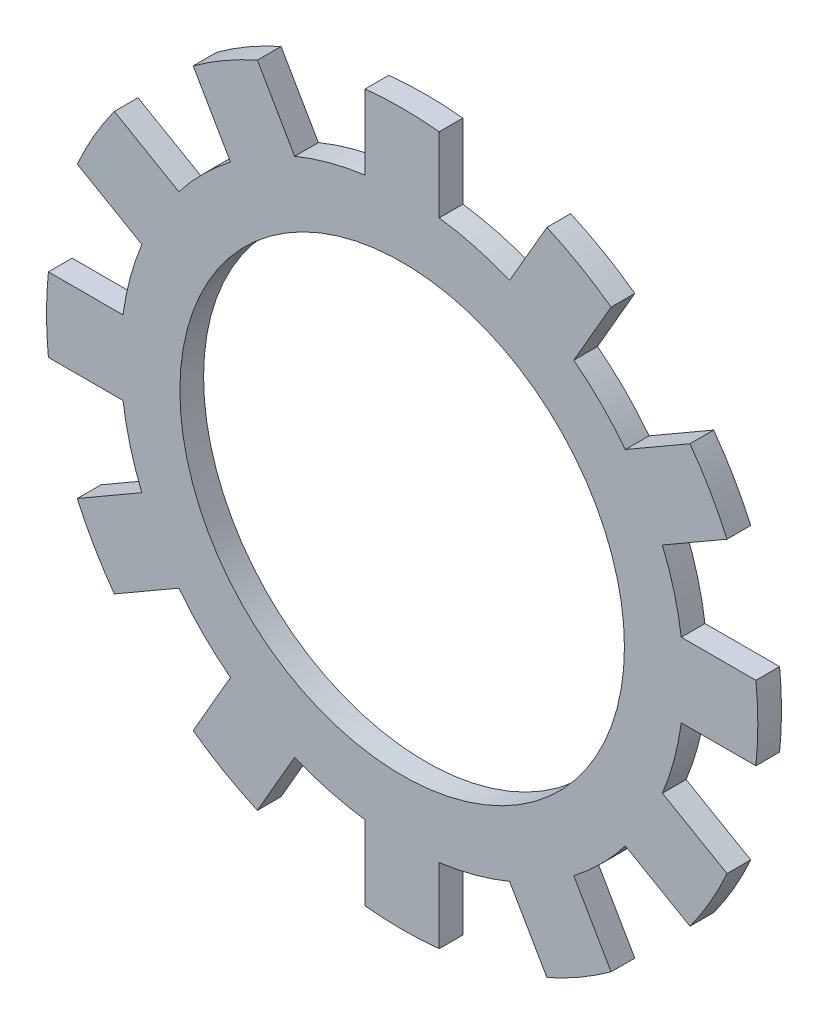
ISO-10303-21;
HEADER;
FILE_DESCRIPTION(('STEP AP214'),'2;1');
FILE_NAME('part.step','',(''),(''),'','','');
FILE_SCHEMA(('AUTOMOTIVE_DESIGN { 1 0 10303 214 1 1 1 1 }'));
ENDSEC;
DATA;
#1=APPLICATION_CONTEXT('core data for automotive mechanical design processes');
#2=APPLICATION_PROTOCOL_DEFINITION('international standard','automotive_design',2000,#1);
#3=PRODUCT_CONTEXT('',#1,'mechanical');
#4=PRODUCT('Part','Part','',(#3));
#5=PRODUCT_RELATED_PRODUCT_CATEGORY('part','',(#4));
#6=PRODUCT_DEFINITION_FORMATION('','',#4);
#7=PRODUCT_DEFINITION_CONTEXT('part definition',#1,'design');
#8=PRODUCT_DEFINITION('design','',#6,#7);
#9=PRODUCT_DEFINITION_SHAPE('','',#8);
#10=(LENGTH_UNIT() NAMED_UNIT(*) SI_UNIT(.MILLI.,.METRE.));
#11=(NAMED_UNIT(*) PLANE_ANGLE_UNIT() SI_UNIT($,.RADIAN.));
#12=(NAMED_UNIT(*) SI_UNIT($,.STERADIAN.) SOLID_ANGLE_UNIT());
#13=UNCERTAINTY_MEASURE_WITH_UNIT(LENGTH_MEASURE(1.E-05),#10,'distance_accuracy_value','');
#14=(GEOMETRIC_REPRESENTATION_CONTEXT(3) GLOBAL_UNCERTAINTY_ASSIGNED_CONTEXT((#13)) GLOBAL_UNIT_ASSIGNED_CONTEXT((#10,
#11,#12)) REPRESENTATION_CONTEXT('',''));
#15=CARTESIAN_POINT('',(0.,0.,0.));
#16=DIRECTION('',(0.,0.,1.));
#17=DIRECTION('',(1.,0.,0.));
#18=AXIS2_PLACEMENT_3D('',#15,#16,#17);
#19=CARTESIAN_POINT('',(0.,0.,0.8));
#20=DIRECTION('',(0.,0.,-1.));
#21=DIRECTION('',(-1.,0.,0.));
#22=AXIS2_PLACEMENT_3D('',#19,#20,#21);
#23=CYLINDRICAL_SURFACE('',#22,19.);
#24=CARTESIAN_POINT('',(0.,0.,-0.8));
#25=DIRECTION('',(0.,0.,1.));
#26=DIRECTION('',(1.,0.,0.));
#27=AXIS2_PLACEMENT_3D('',#24,#25,#26);
#28=CIRCLE('',#27,19.);
#29=CARTESIAN_POINT('',(15.0614223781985,11.58246761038,-0.8));
#30=VERTEX_POINT('',#29);
#31=CARTESIAN_POINT('',(11.5824676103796,15.0614223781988,-0.8));
#32=VERTEX_POINT('',#31);
#33=EDGE_CURVE('E361',#30,#32,#28,.T.);
#34=ORIENTED_EDGE('',*,*,#33,.T.);
#35=DIRECTION('',(0.,0.,-1.));
#36=VECTOR('',#35,1.);
#37=CARTESIAN_POINT('',(11.5824676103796,15.0614223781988,0.8));
#38=LINE('',#37,#36);
#39=CARTESIAN_POINT('',(11.5824676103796,15.0614223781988,0.8));
#40=VERTEX_POINT('',#39);
#41=EDGE_CURVE('E352',#40,#32,#38,.T.);
#42=ORIENTED_EDGE('',*,*,#41,.F.);
#43=CARTESIAN_POINT('',(0.,0.,0.8));
#44=DIRECTION('',(0.,0.,1.));
#45=DIRECTION('',(1.,0.,0.));
#46=AXIS2_PLACEMENT_3D('',#43,#44,#45);
#47=CIRCLE('',#46,19.);
#48=CARTESIAN_POINT('',(15.0614223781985,11.58246761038,0.8));
#49=VERTEX_POINT('',#48);
#50=EDGE_CURVE('E64',#49,#40,#47,.T.);
#51=ORIENTED_EDGE('',*,*,#50,.F.);
#52=DIRECTION('',(0.,0.,-1.));
#53=VECTOR('',#52,1.);
#54=CARTESIAN_POINT('',(15.0614223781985,11.58246761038,0.8));
#55=LINE('',#54,#53);
#56=EDGE_CURVE('E627',#49,#30,#55,.T.);
#57=ORIENTED_EDGE('',*,*,#56,.T.);
#58=EDGE_LOOP('',(#34,#42,#51,#57));
#59=FACE_BOUND('',#58,.T.);
#60=ADVANCED_FACE('F39',(#59),#23,.T.);
#61=DIRECTION('',(0.,0.,-1.));
#62=VECTOR('',#61,1.);
#63=CARTESIAN_POINT('',(7.25234059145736,17.5614223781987,0.8));
#64=LINE('',#63,#62);
#65=CARTESIAN_POINT('',(7.25234059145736,17.5614223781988,0.8));
#66=VERTEX_POINT('',#65);
#67=CARTESIAN_POINT('',(7.25234059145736,17.5614223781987,-0.8));
#68=VERTEX_POINT('',#67);
#69=EDGE_CURVE('E646',#66,#68,#64,.T.);
#70=ORIENTED_EDGE('',*,*,#69,.T.);
#71=CARTESIAN_POINT('',(2.5,18.8348082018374,-0.8));
#72=VERTEX_POINT('',#71);
#73=EDGE_CURVE('E388',#68,#72,#28,.T.);
#74=ORIENTED_EDGE('',*,*,#73,.T.);
#75=DIRECTION('',(0.,0.,-1.));
#76=VECTOR('',#75,1.);
#77=CARTESIAN_POINT('',(2.5,18.8348082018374,0.8));
#78=LINE('',#77,#76);
#79=CARTESIAN_POINT('',(2.5,18.8348082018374,0.8));
#80=VERTEX_POINT('',#79);
#81=EDGE_CURVE('E405',#80,#72,#78,.T.);
#82=ORIENTED_EDGE('',*,*,#81,.F.);
#83=EDGE_CURVE('E50',#66,#80,#47,.T.);
#84=ORIENTED_EDGE('',*,*,#83,.F.);
#85=EDGE_LOOP('',(#70,#74,#82,#84));
#86=FACE_BOUND('',#85,.T.);
#87=ADVANCED_FACE('F816',(#86),#23,.T.);
#88=CARTESIAN_POINT('',(18.8348082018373,2.5000000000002,-0.8));
#89=VERTEX_POINT('',#88);
#90=CARTESIAN_POINT('',(17.5614223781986,7.25234059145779,-0.8));
#91=VERTEX_POINT('',#90);
#92=EDGE_CURVE('E907',#89,#91,#28,.T.);
#93=ORIENTED_EDGE('',*,*,#92,.T.);
#94=DIRECTION('',(0.,0.,-1.));
#95=VECTOR('',#94,1.);
#96=CARTESIAN_POINT('',(17.5614223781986,7.25234059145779,0.8));
#97=LINE('',#96,#95);
#98=CARTESIAN_POINT('',(17.5614223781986,7.25234059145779,0.8));
#99=VERTEX_POINT('',#98);
#100=EDGE_CURVE('E785',#99,#91,#97,.T.);
#101=ORIENTED_EDGE('',*,*,#100,.F.);
#102=CARTESIAN_POINT('',(18.8348082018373,2.5000000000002,0.8));
#103=VERTEX_POINT('',#102);
#104=EDGE_CURVE('E371',#103,#99,#47,.T.);
#105=ORIENTED_EDGE('',*,*,#104,.F.);
#106=DIRECTION('',(0.,0.,-1.));
#107=VECTOR('',#106,1.);
#108=CARTESIAN_POINT('',(18.8348082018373,2.5000000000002,0.8));
#109=LINE('',#108,#107);
#110=EDGE_CURVE('E605',#103,#89,#109,.T.);
#111=ORIENTED_EDGE('',*,*,#110,.T.);
#112=EDGE_LOOP('',(#93,#101,#105,#111));
#113=FACE_BOUND('',#112,.T.);
#114=ADVANCED_FACE('F905',(#113),#23,.T.);
#115=CARTESIAN_POINT('',(17.5614223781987,-7.25234059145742,-0.8));
#116=VERTEX_POINT('',#115);
#117=CARTESIAN_POINT('',(18.8348082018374,-2.4999999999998,-0.8));
#118=VERTEX_POINT('',#117);
#119=EDGE_CURVE('E888',#116,#118,#28,.T.);
#120=ORIENTED_EDGE('',*,*,#119,.T.);
#121=DIRECTION('',(0.,0.,-1.));
#122=VECTOR('',#121,1.);
#123=CARTESIAN_POINT('',(18.8348082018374,-2.4999999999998,0.8));
#124=LINE('',#123,#122);
#125=CARTESIAN_POINT('',(18.8348082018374,-2.4999999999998,0.8));
#126=VERTEX_POINT('',#125);
#127=EDGE_CURVE('E772',#126,#118,#124,.T.);
#128=ORIENTED_EDGE('',*,*,#127,.F.);
#129=CARTESIAN_POINT('',(17.5614223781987,-7.25234059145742,0.8));
#130=VERTEX_POINT('',#129);
#131=EDGE_CURVE('E376',#130,#126,#47,.T.);
#132=ORIENTED_EDGE('',*,*,#131,.F.);
#133=DIRECTION('',(0.,0.,-1.));
#134=VECTOR('',#133,1.);
#135=CARTESIAN_POINT('',(17.5614223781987,-7.25234059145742,0.8));
#136=LINE('',#135,#134);
#137=EDGE_CURVE('E583',#130,#116,#136,.T.);
#138=ORIENTED_EDGE('',*,*,#137,.T.);
#139=EDGE_LOOP('',(#120,#128,#132,#138));
#140=FACE_BOUND('',#139,.T.);
#141=ADVANCED_FACE('F887',(#140),#23,.T.);
#142=CARTESIAN_POINT('',(11.5824676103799,-15.0614223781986,-0.8));
#143=VERTEX_POINT('',#142);
#144=CARTESIAN_POINT('',(15.0614223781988,-11.5824676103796,-0.8));
#145=VERTEX_POINT('',#144);
#146=EDGE_CURVE('E964',#143,#145,#28,.T.);
#147=ORIENTED_EDGE('',*,*,#146,.T.);
#148=DIRECTION('',(0.,0.,-1.));
#149=VECTOR('',#148,1.);
#150=CARTESIAN_POINT('',(15.0614223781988,-11.5824676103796,0.8));
#151=LINE('',#150,#149);
#152=CARTESIAN_POINT('',(15.0614223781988,-11.5824676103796,0.8));
#153=VERTEX_POINT('',#152);
#154=EDGE_CURVE('E758',#153,#145,#151,.T.);
#155=ORIENTED_EDGE('',*,*,#154,.F.);
#156=CARTESIAN_POINT('',(11.5824676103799,-15.0614223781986,0.8));
#157=VERTEX_POINT('',#156);
#158=EDGE_CURVE('E873',#157,#153,#47,.T.);
#159=ORIENTED_EDGE('',*,*,#158,.F.);
#160=DIRECTION('',(0.,0.,-1.));
#161=VECTOR('',#160,1.);
#162=CARTESIAN_POINT('',(11.5824676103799,-15.0614223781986,0.8));
#163=LINE('',#162,#161);
#164=EDGE_CURVE('E561',#157,#143,#163,.T.);
#165=ORIENTED_EDGE('',*,*,#164,.T.);
#166=EDGE_LOOP('',(#147,#155,#159,#165));
#167=FACE_BOUND('',#166,.T.);
#168=ADVANCED_FACE('F974',(#167),#23,.T.);
#169=CARTESIAN_POINT('',(2.5,-18.8348082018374,-0.8));
#170=VERTEX_POINT('',#169);
#171=CARTESIAN_POINT('',(7.25234059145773,-17.5614223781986,-0.8));
#172=VERTEX_POINT('',#171);
#173=EDGE_CURVE('E959',#170,#172,#28,.T.);
#174=ORIENTED_EDGE('',*,*,#173,.T.);
#175=DIRECTION('',(0.,0.,-1.));
#176=VECTOR('',#175,1.);
#177=CARTESIAN_POINT('',(7.25234059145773,-17.5614223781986,0.8));
#178=LINE('',#177,#176);
#179=CARTESIAN_POINT('',(7.25234059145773,-17.5614223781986,0.8));
#180=VERTEX_POINT('',#179);
#181=EDGE_CURVE('E744',#180,#172,#178,.T.);
#182=ORIENTED_EDGE('',*,*,#181,.F.);
#183=CARTESIAN_POINT('',(2.5,-18.8348082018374,0.8));
#184=VERTEX_POINT('',#183);
#185=EDGE_CURVE('E868',#184,#180,#47,.T.);
#186=ORIENTED_EDGE('',*,*,#185,.F.);
#187=DIRECTION('',(0.,0.,-1.));
#188=VECTOR('',#187,1.);
#189=CARTESIAN_POINT('',(2.5,-18.8348082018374,0.8));
#190=LINE('',#189,#188);
#191=EDGE_CURVE('E539',#184,#170,#190,.T.);
#192=ORIENTED_EDGE('',*,*,#191,.T.);
#193=EDGE_LOOP('',(#174,#182,#186,#192));
#194=FACE_BOUND('',#193,.T.);
#195=ADVANCED_FACE('F1402',(#194),#23,.T.);
#196=CARTESIAN_POINT('',(-7.25234059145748,-17.5614223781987,-0.8));
#197=VERTEX_POINT('',#196);
#198=CARTESIAN_POINT('',(-2.5,-18.8348082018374,-0.8));
#199=VERTEX_POINT('',#198);
#200=EDGE_CURVE('E955',#197,#199,#28,.T.);
#201=ORIENTED_EDGE('',*,*,#200,.T.);
#202=DIRECTION('',(0.,0.,-1.));
#203=VECTOR('',#202,1.);
#204=CARTESIAN_POINT('',(-2.5,-18.8348082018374,0.8));
#205=LINE('',#204,#203);
#206=CARTESIAN_POINT('',(-2.5,-18.8348082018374,0.8));
#207=VERTEX_POINT('',#206);
#208=EDGE_CURVE('E730',#207,#199,#205,.T.);
#209=ORIENTED_EDGE('',*,*,#208,.F.);
#210=CARTESIAN_POINT('',(-7.25234059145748,-17.5614223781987,0.8));
#211=VERTEX_POINT('',#210);
#212=EDGE_CURVE('E864',#211,#207,#47,.T.);
#213=ORIENTED_EDGE('',*,*,#212,.F.);
#214=DIRECTION('',(0.,0.,-1.));
#215=VECTOR('',#214,1.);
#216=CARTESIAN_POINT('',(-7.25234059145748,-17.5614223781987,0.8));
#217=LINE('',#216,#215);
#218=EDGE_CURVE('E518',#211,#197,#217,.T.);
#219=ORIENTED_EDGE('',*,*,#218,.T.);
#220=EDGE_LOOP('',(#201,#209,#213,#219));
#221=FACE_BOUND('',#220,.T.);
#222=ADVANCED_FACE('F1394',(#221),#23,.T.);
#223=CARTESIAN_POINT('',(-15.0614223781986,-11.5824676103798,-0.8));
#224=VERTEX_POINT('',#223);
#225=CARTESIAN_POINT('',(-11.5824676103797,-15.0614223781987,-0.8));
#226=VERTEX_POINT('',#225);
#227=EDGE_CURVE('E950',#224,#226,#28,.T.);
#228=ORIENTED_EDGE('',*,*,#227,.T.);
#229=DIRECTION('',(0.,0.,-1.));
#230=VECTOR('',#229,1.);
#231=CARTESIAN_POINT('',(-11.5824676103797,-15.0614223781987,0.8));
#232=LINE('',#231,#230);
#233=CARTESIAN_POINT('',(-11.5824676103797,-15.0614223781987,0.8));
#234=VERTEX_POINT('',#233);
#235=EDGE_CURVE('E716',#234,#226,#232,.T.);
#236=ORIENTED_EDGE('',*,*,#235,.F.);
#237=CARTESIAN_POINT('',(-15.0614223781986,-11.5824676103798,0.8));
#238=VERTEX_POINT('',#237);
#239=EDGE_CURVE('E860',#238,#234,#47,.T.);
#240=ORIENTED_EDGE('',*,*,#239,.F.);
#241=DIRECTION('',(0.,0.,-1.));
#242=VECTOR('',#241,1.);
#243=CARTESIAN_POINT('',(-15.0614223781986,-11.5824676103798,0.8));
#244=LINE('',#243,#242);
#245=EDGE_CURVE('E496',#238,#224,#244,.T.);
#246=ORIENTED_EDGE('',*,*,#245,.T.);
#247=EDGE_LOOP('',(#228,#236,#240,#246));
#248=FACE_BOUND('',#247,.T.);
#249=ADVANCED_FACE('F1386',(#248),#23,.T.);
#250=CARTESIAN_POINT('',(-18.8348082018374,-2.50000000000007,-0.8));
#251=VERTEX_POINT('',#250);
#252=CARTESIAN_POINT('',(-17.5614223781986,-7.25234059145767,-0.8));
#253=VERTEX_POINT('',#252);
#254=EDGE_CURVE('E947',#251,#253,#28,.T.);
#255=ORIENTED_EDGE('',*,*,#254,.T.);
#256=DIRECTION('',(0.,0.,-1.));
#257=VECTOR('',#256,1.);
#258=CARTESIAN_POINT('',(-17.5614223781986,-7.25234059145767,0.8));
#259=LINE('',#258,#257);
#260=CARTESIAN_POINT('',(-17.5614223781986,-7.25234059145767,0.8));
#261=VERTEX_POINT('',#260);
#262=EDGE_CURVE('E702',#261,#253,#259,.T.);
#263=ORIENTED_EDGE('',*,*,#262,.F.);
#264=CARTESIAN_POINT('',(-18.8348082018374,-2.50000000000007,0.8));
#265=VERTEX_POINT('',#264);
#266=EDGE_CURVE('E855',#265,#261,#47,.T.);
#267=ORIENTED_EDGE('',*,*,#266,.F.);
#268=DIRECTION('',(0.,0.,-1.));
#269=VECTOR('',#268,1.);
#270=CARTESIAN_POINT('',(-18.8348082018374,-2.50000000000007,0.8));
#271=LINE('',#270,#269);
#272=EDGE_CURVE('E474',#265,#251,#271,.T.);
#273=ORIENTED_EDGE('',*,*,#272,.T.);
#274=EDGE_LOOP('',(#255,#263,#267,#273));
#275=FACE_BOUND('',#274,.T.);
#276=ADVANCED_FACE('F940',(#275),#23,.T.);
#277=CARTESIAN_POINT('',(-17.5614223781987,7.25234059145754,-0.8));
#278=VERTEX_POINT('',#277);
#279=CARTESIAN_POINT('',(-18.8348082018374,2.49999999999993,-0.8));
#280=VERTEX_POINT('',#279);
#281=EDGE_CURVE('E944',#278,#280,#28,.T.);
#282=ORIENTED_EDGE('',*,*,#281,.T.);
#283=DIRECTION('',(0.,0.,-1.));
#284=VECTOR('',#283,1.);
#285=CARTESIAN_POINT('',(-18.8348082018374,2.49999999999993,0.8));
#286=LINE('',#285,#284);
#287=CARTESIAN_POINT('',(-18.8348082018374,2.49999999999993,0.8));
#288=VERTEX_POINT('',#287);
#289=EDGE_CURVE('E688',#288,#280,#286,.T.);
#290=ORIENTED_EDGE('',*,*,#289,.F.);
#291=CARTESIAN_POINT('',(-17.5614223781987,7.25234059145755,0.8));
#292=VERTEX_POINT('',#291);
#293=EDGE_CURVE('E851',#292,#288,#47,.T.);
#294=ORIENTED_EDGE('',*,*,#293,.F.);
#295=DIRECTION('',(0.,0.,-1.));
#296=VECTOR('',#295,1.);
#297=CARTESIAN_POINT('',(-17.5614223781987,7.25234059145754,0.8));
#298=LINE('',#297,#296);
#299=EDGE_CURVE('E452',#292,#278,#298,.T.);
#300=ORIENTED_EDGE('',*,*,#299,.T.);
#301=EDGE_LOOP('',(#282,#290,#294,#300));
#302=FACE_BOUND('',#301,.T.);
#303=ADVANCED_FACE('F936',(#302),#23,.T.);
#304=CARTESIAN_POINT('',(-11.5824676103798,15.0614223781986,-0.8));
#305=VERTEX_POINT('',#304);
#306=CARTESIAN_POINT('',(-15.0614223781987,11.5824676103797,-0.8));
#307=VERTEX_POINT('',#306);
#308=EDGE_CURVE('E943',#305,#307,#28,.T.);
#309=ORIENTED_EDGE('',*,*,#308,.T.);
#310=DIRECTION('',(0.,0.,-1.));
#311=VECTOR('',#310,1.);
#312=CARTESIAN_POINT('',(-15.0614223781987,11.5824676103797,0.8));
#313=LINE('',#312,#311);
#314=CARTESIAN_POINT('',(-15.0614223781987,11.5824676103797,0.8));
#315=VERTEX_POINT('',#314);
#316=EDGE_CURVE('E674',#315,#307,#313,.T.);
#317=ORIENTED_EDGE('',*,*,#316,.F.);
#318=CARTESIAN_POINT('',(-11.5824676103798,15.0614223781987,0.8));
#319=VERTEX_POINT('',#318);
#320=EDGE_CURVE('E49',#319,#315,#47,.T.);
#321=ORIENTED_EDGE('',*,*,#320,.F.);
#322=DIRECTION('',(0.,0.,-1.));
#323=VECTOR('',#322,1.);
#324=CARTESIAN_POINT('',(-11.5824676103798,15.0614223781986,0.8));
#325=LINE('',#324,#323);
#326=EDGE_CURVE('E430',#319,#305,#325,.T.);
#327=ORIENTED_EDGE('',*,*,#326,.T.);
#328=EDGE_LOOP('',(#309,#317,#321,#327));
#329=FACE_BOUND('',#328,.T.);
#330=ADVANCED_FACE('F930',(#329),#23,.T.);
#331=CARTESIAN_POINT('',(-2.5,18.8348082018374,-0.8));
#332=VERTEX_POINT('',#331);
#333=CARTESIAN_POINT('',(-7.2523405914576,17.5614223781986,-0.8));
#334=VERTEX_POINT('',#333);
#335=EDGE_CURVE('E43',#332,#334,#28,.T.);
#336=ORIENTED_EDGE('',*,*,#335,.T.);
#337=DIRECTION('',(0.,0.,-1.));
#338=VECTOR('',#337,1.);
#339=CARTESIAN_POINT('',(-7.2523405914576,17.5614223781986,0.8));
#340=LINE('',#339,#338);
#341=CARTESIAN_POINT('',(-7.2523405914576,17.5614223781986,0.8));
#342=VERTEX_POINT('',#341);
#343=EDGE_CURVE('E658',#342,#334,#340,.T.);
#344=ORIENTED_EDGE('',*,*,#343,.F.);
#345=CARTESIAN_POINT('',(-2.5,18.8348082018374,0.8));
#346=VERTEX_POINT('',#345);
#347=EDGE_CURVE('E11',#346,#342,#47,.T.);
#348=ORIENTED_EDGE('',*,*,#347,.F.);
#349=DIRECTION('',(0.,0.,-1.));
#350=VECTOR('',#349,1.);
#351=CARTESIAN_POINT('',(-2.5,18.8348082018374,0.8));
#352=LINE('',#351,#350);
#353=EDGE_CURVE('E392',#346,#332,#352,.T.);
#354=ORIENTED_EDGE('',*,*,#353,.T.);
#355=EDGE_LOOP('',(#336,#344,#348,#354));
#356=FACE_BOUND('',#355,.T.);
#357=ADVANCED_FACE('F41',(#356),#23,.T.);
#358=CARTESIAN_POINT('',(0.,0.,0.8));
#359=DIRECTION('',(0.,0.,1.));
#360=DIRECTION('',(1.,0.,0.));
#361=AXIS2_PLACEMENT_3D('',#358,#359,#360);
#362=PLANE('',#361);
#363=ORIENTED_EDGE('',*,*,#347,.T.);
#364=DIRECTION('',(0.500000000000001,-0.866025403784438,0.));
#365=VECTOR('',#364,1.);
#366=CARTESIAN_POINT('',(-9.76965475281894,21.9215384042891,0.8));
#367=LINE('',#366,#365);
#368=CARTESIAN_POINT('',(-9.76965475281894,21.9215384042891,0.8));
#369=VERTEX_POINT('',#368);
#370=EDGE_CURVE('E669',#369,#342,#367,.T.);
#371=ORIENTED_EDGE('',*,*,#370,.F.);
#372=CARTESIAN_POINT('',(0.,0.,0.8));
#373=DIRECTION('',(0.,0.,1.));
#374=DIRECTION('',(0.866025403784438,0.500000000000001,0.));
#375=AXIS2_PLACEMENT_3D('',#372,#373,#374);
#376=CIRCLE('',#375,24.);
#377=CARTESIAN_POINT('',(-14.0997817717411,19.4215384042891,0.8));
#378=VERTEX_POINT('',#377);
#379=EDGE_CURVE('E439',#369,#378,#376,.T.);
#380=ORIENTED_EDGE('',*,*,#379,.T.);
#381=DIRECTION('',(0.500000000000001,-0.866025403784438,0.));
#382=VECTOR('',#381,1.);
#383=CARTESIAN_POINT('',(-14.0997817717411,19.4215384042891,0.8));
#384=LINE('',#383,#382);
#385=EDGE_CURVE('E434',#378,#319,#384,.T.);
#386=ORIENTED_EDGE('',*,*,#385,.T.);
#387=ORIENTED_EDGE('',*,*,#320,.T.);
#388=DIRECTION('',(0.86602540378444,-0.499999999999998,0.));
#389=VECTOR('',#388,1.);
#390=CARTESIAN_POINT('',(-19.4215384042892,14.0997817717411,0.8));
#391=LINE('',#390,#389);
#392=CARTESIAN_POINT('',(-19.4215384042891,14.0997817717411,0.8));
#393=VERTEX_POINT('',#392);
#394=EDGE_CURVE('E683',#393,#315,#391,.T.);
#395=ORIENTED_EDGE('',*,*,#394,.F.);
#396=CARTESIAN_POINT('',(0.,0.,0.8));
#397=DIRECTION('',(0.,0.,1.));
#398=DIRECTION('',(0.499999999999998,0.86602540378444,0.));
#399=AXIS2_PLACEMENT_3D('',#396,#397,#398);
#400=CIRCLE('',#399,24.);
#401=CARTESIAN_POINT('',(-21.9215384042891,9.76965475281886,0.8));
#402=VERTEX_POINT('',#401);
#403=EDGE_CURVE('E461',#393,#402,#400,.T.);
#404=ORIENTED_EDGE('',*,*,#403,.T.);
#405=DIRECTION('',(0.86602540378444,-0.499999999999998,0.));
#406=VECTOR('',#405,1.);
#407=CARTESIAN_POINT('',(-21.9215384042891,9.76965475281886,0.8));
#408=LINE('',#407,#406);
#409=EDGE_CURVE('E456',#402,#292,#408,.T.);
#410=ORIENTED_EDGE('',*,*,#409,.T.);
#411=ORIENTED_EDGE('',*,*,#293,.T.);
#412=DIRECTION('',(1.,0.,0.));
#413=VECTOR('',#412,1.);
#414=CARTESIAN_POINT('',(-23.86943652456,2.49999999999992,0.8));
#415=LINE('',#414,#413);
#416=CARTESIAN_POINT('',(-23.86943652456,2.49999999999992,0.8));
#417=VERTEX_POINT('',#416);
#418=EDGE_CURVE('E697',#417,#288,#415,.T.);
#419=ORIENTED_EDGE('',*,*,#418,.F.);
#420=CARTESIAN_POINT('',(0.,0.,0.8));
#421=DIRECTION('',(0.,0.,1.));
#422=DIRECTION('',(0.,1.,0.));
#423=AXIS2_PLACEMENT_3D('',#420,#421,#422);
#424=CIRCLE('',#423,24.);
#425=CARTESIAN_POINT('',(-23.86943652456,-2.50000000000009,0.8));
#426=VERTEX_POINT('',#425);
#427=EDGE_CURVE('E483',#417,#426,#424,.T.);
#428=ORIENTED_EDGE('',*,*,#427,.T.);
#429=DIRECTION('',(1.,0.,0.));
#430=VECTOR('',#429,1.);
#431=CARTESIAN_POINT('',(-23.86943652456,-2.50000000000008,0.8));
#432=LINE('',#431,#430);
#433=EDGE_CURVE('E478',#426,#265,#432,.T.);
#434=ORIENTED_EDGE('',*,*,#433,.T.);
#435=ORIENTED_EDGE('',*,*,#266,.T.);
#436=DIRECTION('',(0.866025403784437,0.500000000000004,0.));
#437=VECTOR('',#436,1.);
#438=CARTESIAN_POINT('',(-21.9215384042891,-9.76965475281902,0.8));
#439=LINE('',#438,#437);
#440=CARTESIAN_POINT('',(-21.9215384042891,-9.76965475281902,0.8));
#441=VERTEX_POINT('',#440);
#442=EDGE_CURVE('E711',#441,#261,#439,.T.);
#443=ORIENTED_EDGE('',*,*,#442,.F.);
#444=CARTESIAN_POINT('',(0.,0.,0.8));
#445=DIRECTION('',(0.,0.,1.));
#446=DIRECTION('',(-0.500000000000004,0.866025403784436,0.));
#447=AXIS2_PLACEMENT_3D('',#444,#445,#446);
#448=CIRCLE('',#447,24.);
#449=CARTESIAN_POINT('',(-19.4215384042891,-14.0997817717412,0.8));
#450=VERTEX_POINT('',#449);
#451=EDGE_CURVE('E505',#441,#450,#448,.T.);
#452=ORIENTED_EDGE('',*,*,#451,.T.);
#453=DIRECTION('',(0.866025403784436,0.500000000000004,0.));
#454=VECTOR('',#453,1.);
#455=CARTESIAN_POINT('',(-19.4215384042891,-14.0997817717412,0.8));
#456=LINE('',#455,#454);
#457=EDGE_CURVE('E500',#450,#238,#456,.T.);
#458=ORIENTED_EDGE('',*,*,#457,.T.);
#459=ORIENTED_EDGE('',*,*,#239,.T.);
#460=DIRECTION('',(0.499999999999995,0.866025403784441,0.));
#461=VECTOR('',#460,1.);
#462=CARTESIAN_POINT('',(-14.099781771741,-19.4215384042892,0.8));
#463=LINE('',#462,#461);
#464=CARTESIAN_POINT('',(-14.099781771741,-19.4215384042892,0.8));
#465=VERTEX_POINT('',#464);
#466=EDGE_CURVE('E725',#465,#234,#463,.T.);
#467=ORIENTED_EDGE('',*,*,#466,.F.);
#468=CARTESIAN_POINT('',(0.,0.,0.8));
#469=DIRECTION('',(0.,0.,1.));
#470=DIRECTION('',(-0.866025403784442,0.499999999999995,0.));
#471=AXIS2_PLACEMENT_3D('',#468,#469,#470);
#472=CIRCLE('',#471,24.);
#473=CARTESIAN_POINT('',(-9.76965475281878,-21.9215384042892,0.8));
#474=VERTEX_POINT('',#473);
#475=EDGE_CURVE('E527',#465,#474,#472,.T.);
#476=ORIENTED_EDGE('',*,*,#475,.T.);
#477=DIRECTION('',(0.499999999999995,0.866025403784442,0.));
#478=VECTOR('',#477,1.);
#479=CARTESIAN_POINT('',(-9.76965475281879,-21.9215384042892,0.8));
#480=LINE('',#479,#478);
#481=EDGE_CURVE('E522',#474,#211,#480,.T.);
#482=ORIENTED_EDGE('',*,*,#481,.T.);
#483=ORIENTED_EDGE('',*,*,#212,.T.);
#484=DIRECTION('',(0.,1.,0.));
#485=VECTOR('',#484,1.);
#486=CARTESIAN_POINT('',(-2.5,-23.86943652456,0.8));
#487=LINE('',#486,#485);
#488=CARTESIAN_POINT('',(-2.5,-23.86943652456,0.8));
#489=VERTEX_POINT('',#488);
#490=EDGE_CURVE('E739',#489,#207,#487,.T.);
#491=ORIENTED_EDGE('',*,*,#490,.F.);
#492=CARTESIAN_POINT('',(0.,0.,0.8));
#493=DIRECTION('',(0.,0.,1.));
#494=DIRECTION('',(-1.,0.,0.));
#495=AXIS2_PLACEMENT_3D('',#492,#493,#494);
#496=CIRCLE('',#495,24.);
#497=CARTESIAN_POINT('',(2.5,-23.86943652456,0.8));
#498=VERTEX_POINT('',#497);
#499=EDGE_CURVE('E548',#489,#498,#496,.T.);
#500=ORIENTED_EDGE('',*,*,#499,.T.);
#501=DIRECTION('',(0.,1.,0.));
#502=VECTOR('',#501,1.);
#503=CARTESIAN_POINT('',(2.5,-23.86943652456,0.8));
#504=LINE('',#503,#502);
#505=EDGE_CURVE('E543',#498,#184,#504,.T.);
#506=ORIENTED_EDGE('',*,*,#505,.T.);
#507=ORIENTED_EDGE('',*,*,#185,.T.);
#508=DIRECTION('',(-0.500000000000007,0.866025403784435,0.));
#509=VECTOR('',#508,1.);
#510=CARTESIAN_POINT('',(9.7696547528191,-21.921538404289,0.8));
#511=LINE('',#510,#509);
#512=CARTESIAN_POINT('',(9.76965475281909,-21.921538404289,0.8));
#513=VERTEX_POINT('',#512);
#514=EDGE_CURVE('E753',#513,#180,#511,.T.);
#515=ORIENTED_EDGE('',*,*,#514,.F.);
#516=CARTESIAN_POINT('',(0.,0.,0.8));
#517=DIRECTION('',(0.,0.,1.));
#518=DIRECTION('',(-0.866025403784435,-0.500000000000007,0.));
#519=AXIS2_PLACEMENT_3D('',#516,#517,#518);
#520=CIRCLE('',#519,24.);
#521=CARTESIAN_POINT('',(14.0997817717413,-19.421538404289,0.8));
#522=VERTEX_POINT('',#521);
#523=EDGE_CURVE('E570',#513,#522,#520,.T.);
#524=ORIENTED_EDGE('',*,*,#523,.T.);
#525=DIRECTION('',(-0.500000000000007,0.866025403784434,0.));
#526=VECTOR('',#525,1.);
#527=CARTESIAN_POINT('',(14.0997817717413,-19.421538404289,0.8));
#528=LINE('',#527,#526);
#529=EDGE_CURVE('E565',#522,#157,#528,.T.);
#530=ORIENTED_EDGE('',*,*,#529,.T.);
#531=ORIENTED_EDGE('',*,*,#158,.T.);
#532=DIRECTION('',(-0.866025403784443,0.499999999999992,0.));
#533=VECTOR('',#532,1.);
#534=CARTESIAN_POINT('',(19.4215384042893,-14.0997817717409,0.8));
#535=LINE('',#534,#533);
#536=CARTESIAN_POINT('',(19.4215384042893,-14.0997817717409,0.8));
#537=VERTEX_POINT('',#536);
#538=EDGE_CURVE('E767',#537,#153,#535,.T.);
#539=ORIENTED_EDGE('',*,*,#538,.F.);
#540=CARTESIAN_POINT('',(0.,0.,0.8));
#541=DIRECTION('',(0.,0.,1.));
#542=DIRECTION('',(-0.499999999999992,-0.866025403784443,0.));
#543=AXIS2_PLACEMENT_3D('',#540,#541,#542);
#544=CIRCLE('',#543,24.);
#545=CARTESIAN_POINT('',(21.9215384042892,-9.76965475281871,0.8));
#546=VERTEX_POINT('',#545);
#547=EDGE_CURVE('E592',#537,#546,#544,.T.);
#548=ORIENTED_EDGE('',*,*,#547,.T.);
#549=DIRECTION('',(-0.866025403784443,0.499999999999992,0.));
#550=VECTOR('',#549,1.);
#551=CARTESIAN_POINT('',(21.9215384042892,-9.76965475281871,0.8));
#552=LINE('',#551,#550);
#553=EDGE_CURVE('E587',#546,#130,#552,.T.);
#554=ORIENTED_EDGE('',*,*,#553,.T.);
#555=ORIENTED_EDGE('',*,*,#131,.T.);
#556=DIRECTION('',(-1.,0.,0.));
#557=VECTOR('',#556,1.);
#558=CARTESIAN_POINT('',(23.86943652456,-2.49999999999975,0.8));
#559=LINE('',#558,#557);
#560=CARTESIAN_POINT('',(23.86943652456,-2.49999999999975,0.8));
#561=VERTEX_POINT('',#560);
#562=EDGE_CURVE('E780',#561,#126,#559,.T.);
#563=ORIENTED_EDGE('',*,*,#562,.F.);
#564=CARTESIAN_POINT('',(0.,0.,0.8));
#565=DIRECTION('',(0.,0.,1.));
#566=DIRECTION('',(0.,-1.,0.));
#567=AXIS2_PLACEMENT_3D('',#564,#565,#566);
#568=CIRCLE('',#567,24.);
#569=CARTESIAN_POINT('',(23.86943652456,2.50000000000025,0.8));
#570=VERTEX_POINT('',#569);
#571=EDGE_CURVE('E614',#561,#570,#568,.T.);
#572=ORIENTED_EDGE('',*,*,#571,.T.);
#573=DIRECTION('',(-1.,0.,0.));
#574=VECTOR('',#573,1.);
#575=CARTESIAN_POINT('',(23.86943652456,2.50000000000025,0.8));
#576=LINE('',#575,#574);
#577=EDGE_CURVE('E609',#570,#103,#576,.T.);
#578=ORIENTED_EDGE('',*,*,#577,.T.);
#579=ORIENTED_EDGE('',*,*,#104,.T.);
#580=DIRECTION('',(-0.866025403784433,-0.50000000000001,0.));
#581=VECTOR('',#580,1.);
#582=CARTESIAN_POINT('',(21.921538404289,9.76965475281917,0.8));
#583=LINE('',#582,#581);
#584=CARTESIAN_POINT('',(21.921538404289,9.76965475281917,0.8));
#585=VERTEX_POINT('',#584);
#586=EDGE_CURVE('E794',#585,#99,#583,.T.);
#587=ORIENTED_EDGE('',*,*,#586,.F.);
#588=CARTESIAN_POINT('',(0.,0.,0.8));
#589=DIRECTION('',(0.,0.,1.));
#590=DIRECTION('',(0.50000000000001,-0.866025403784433,0.));
#591=AXIS2_PLACEMENT_3D('',#588,#589,#590);
#592=CIRCLE('',#591,24.);
#593=CARTESIAN_POINT('',(19.421538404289,14.0997817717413,0.8));
#594=VERTEX_POINT('',#593);
#595=EDGE_CURVE('E634',#585,#594,#592,.T.);
#596=ORIENTED_EDGE('',*,*,#595,.T.);
#597=DIRECTION('',(-0.866025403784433,-0.50000000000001,0.));
#598=VECTOR('',#597,1.);
#599=CARTESIAN_POINT('',(19.421538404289,14.0997817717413,0.8));
#600=LINE('',#599,#598);
#601=EDGE_CURVE('E368',#594,#49,#600,.T.);
#602=ORIENTED_EDGE('',*,*,#601,.T.);
#603=ORIENTED_EDGE('',*,*,#50,.T.);
#604=DIRECTION('',(-0.499999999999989,-0.866025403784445,0.));
#605=VECTOR('',#604,1.);
#606=CARTESIAN_POINT('',(14.0997817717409,19.4215384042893,0.8));
#607=LINE('',#606,#605);
#608=CARTESIAN_POINT('',(14.0997817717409,19.4215384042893,0.8));
#609=VERTEX_POINT('',#608);
#610=EDGE_CURVE('E349',#609,#40,#607,.T.);
#611=ORIENTED_EDGE('',*,*,#610,.F.);
#612=CARTESIAN_POINT('',(0.,0.,0.8));
#613=DIRECTION('',(0.,0.,1.));
#614=DIRECTION('',(0.866025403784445,-0.499999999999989,0.));
#615=AXIS2_PLACEMENT_3D('',#612,#613,#614);
#616=CIRCLE('',#615,24.);
#617=CARTESIAN_POINT('',(9.76965475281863,21.9215384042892,0.8));
#618=VERTEX_POINT('',#617);
#619=EDGE_CURVE('E654',#609,#618,#616,.T.);
#620=ORIENTED_EDGE('',*,*,#619,.T.);
#621=DIRECTION('',(-0.499999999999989,-0.866025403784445,0.));
#622=VECTOR('',#621,1.);
#623=CARTESIAN_POINT('',(9.76965475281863,21.9215384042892,0.8));
#624=LINE('',#623,#622);
#625=EDGE_CURVE('E649',#618,#66,#624,.T.);
#626=ORIENTED_EDGE('',*,*,#625,.T.);
#627=ORIENTED_EDGE('',*,*,#83,.T.);
#628=DIRECTION('',(0.,-1.,0.));
#629=VECTOR('',#628,1.);
#630=CARTESIAN_POINT('',(2.5,23.86943652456,0.8));
#631=LINE('',#630,#629);
#632=CARTESIAN_POINT('',(2.5,23.86943652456,0.8));
#633=VERTEX_POINT('',#632);
#634=EDGE_CURVE('E418',#633,#80,#631,.T.);
#635=ORIENTED_EDGE('',*,*,#634,.F.);
#636=CARTESIAN_POINT('',(0.,0.,0.8));
#637=DIRECTION('',(0.,0.,1.));
#638=DIRECTION('',(1.,0.,0.));
#639=AXIS2_PLACEMENT_3D('',#636,#637,#638);
#640=CIRCLE('',#639,24.);
#641=CARTESIAN_POINT('',(-2.5,23.86943652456,0.8));
#642=VERTEX_POINT('',#641);
#643=EDGE_CURVE('E401',#633,#642,#640,.T.);
#644=ORIENTED_EDGE('',*,*,#643,.T.);
#645=DIRECTION('',(0.,-1.,0.));
#646=VECTOR('',#645,1.);
#647=CARTESIAN_POINT('',(-2.5,23.86943652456,0.8));
#648=LINE('',#647,#646);
#649=EDGE_CURVE('E396',#642,#346,#648,.T.);
#650=ORIENTED_EDGE('',*,*,#649,.T.);
#651=EDGE_LOOP('',(#363,#371,#380,#386,#387,#395,#404,#410,#411,#419,#428,#434,#435,#443,#452,
#458,#459,#467,#476,#482,#483,#491,#500,#506,#507,#515,#524,#530,#531,#539,#548,#554,#555,#563,
#572,#578,#579,#587,#596,#602,#603,#611,#620,#626,#627,#635,#644,#650));
#652=FACE_BOUND('',#651,.T.);
#653=CARTESIAN_POINT('',(0.,0.,0.8));
#654=DIRECTION('',(0.,0.,1.));
#655=DIRECTION('',(1.,0.,0.));
#656=AXIS2_PLACEMENT_3D('',#653,#654,#655);
#657=CIRCLE('',#656,15.);
#658=CARTESIAN_POINT('',(15.,0.,0.8));
#659=VERTEX_POINT('',#658);
#660=EDGE_CURVE('E383',#659,#659,#657,.T.);
#661=ORIENTED_EDGE('',*,*,#660,.F.);
#662=EDGE_LOOP('',(#661));
#663=FACE_BOUND('',#662,.T.);
#664=ADVANCED_FACE('F365',(#652,#663),#362,.T.);
#665=CARTESIAN_POINT('',(0.,0.,-0.8));
#666=DIRECTION('',(0.,0.,1.));
#667=DIRECTION('',(1.,0.,0.));
#668=AXIS2_PLACEMENT_3D('',#665,#666,#667);
#669=PLANE('',#668);
#670=ORIENTED_EDGE('',*,*,#335,.F.);
#671=DIRECTION('',(0.,-1.,0.));
#672=VECTOR('',#671,1.);
#673=CARTESIAN_POINT('',(-2.5,23.86943652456,-0.8));
#674=LINE('',#673,#672);
#675=CARTESIAN_POINT('',(-2.5,23.86943652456,-0.8));
#676=VERTEX_POINT('',#675);
#677=EDGE_CURVE('E397',#676,#332,#674,.T.);
#678=ORIENTED_EDGE('',*,*,#677,.F.);
#679=CARTESIAN_POINT('',(0.,0.,-0.8));
#680=DIRECTION('',(0.,0.,1.));
#681=DIRECTION('',(1.,0.,0.));
#682=AXIS2_PLACEMENT_3D('',#679,#680,#681);
#683=CIRCLE('',#682,24.);
#684=CARTESIAN_POINT('',(2.5,23.86943652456,-0.8));
#685=VERTEX_POINT('',#684);
#686=EDGE_CURVE('E402',#685,#676,#683,.T.);
#687=ORIENTED_EDGE('',*,*,#686,.F.);
#688=DIRECTION('',(0.,-1.,0.));
#689=VECTOR('',#688,1.);
#690=CARTESIAN_POINT('',(2.5,23.86943652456,-0.8));
#691=LINE('',#690,#689);
#692=EDGE_CURVE('E419',#685,#72,#691,.T.);
#693=ORIENTED_EDGE('',*,*,#692,.T.);
#694=ORIENTED_EDGE('',*,*,#73,.F.);
#695=DIRECTION('',(-0.499999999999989,-0.866025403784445,0.));
#696=VECTOR('',#695,1.);
#697=CARTESIAN_POINT('',(9.76965475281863,21.9215384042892,-0.8));
#698=LINE('',#697,#696);
#699=CARTESIAN_POINT('',(9.76965475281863,21.9215384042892,-0.8));
#700=VERTEX_POINT('',#699);
#701=EDGE_CURVE('E650',#700,#68,#698,.T.);
#702=ORIENTED_EDGE('',*,*,#701,.F.);
#703=CARTESIAN_POINT('',(0.,0.,-0.8));
#704=DIRECTION('',(0.,0.,1.));
#705=DIRECTION('',(0.866025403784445,-0.499999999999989,0.));
#706=AXIS2_PLACEMENT_3D('',#703,#704,#705);
#707=CIRCLE('',#706,24.);
#708=CARTESIAN_POINT('',(14.0997817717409,19.4215384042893,-0.8));
#709=VERTEX_POINT('',#708);
#710=EDGE_CURVE('E655',#709,#700,#707,.T.);
#711=ORIENTED_EDGE('',*,*,#710,.F.);
#712=DIRECTION('',(-0.499999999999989,-0.866025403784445,0.));
#713=VECTOR('',#712,1.);
#714=CARTESIAN_POINT('',(14.0997817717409,19.4215384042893,-0.8));
#715=LINE('',#714,#713);
#716=EDGE_CURVE('E358',#709,#32,#715,.T.);
#717=ORIENTED_EDGE('',*,*,#716,.T.);
#718=ORIENTED_EDGE('',*,*,#33,.F.);
#719=DIRECTION('',(-0.866025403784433,-0.50000000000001,0.));
#720=VECTOR('',#719,1.);
#721=CARTESIAN_POINT('',(19.421538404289,14.0997817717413,-0.8));
#722=LINE('',#721,#720);
#723=CARTESIAN_POINT('',(19.421538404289,14.0997817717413,-0.8));
#724=VERTEX_POINT('',#723);
#725=EDGE_CURVE('E630',#724,#30,#722,.T.);
#726=ORIENTED_EDGE('',*,*,#725,.F.);
#727=CARTESIAN_POINT('',(0.,0.,-0.8));
#728=DIRECTION('',(0.,0.,1.));
#729=DIRECTION('',(0.50000000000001,-0.866025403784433,0.));
#730=AXIS2_PLACEMENT_3D('',#727,#728,#729);
#731=CIRCLE('',#730,24.);
#732=CARTESIAN_POINT('',(21.921538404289,9.76965475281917,-0.8));
#733=VERTEX_POINT('',#732);
#734=EDGE_CURVE('E635',#733,#724,#731,.T.);
#735=ORIENTED_EDGE('',*,*,#734,.F.);
#736=DIRECTION('',(-0.866025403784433,-0.50000000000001,0.));
#737=VECTOR('',#736,1.);
#738=CARTESIAN_POINT('',(21.921538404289,9.76965475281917,-0.8));
#739=LINE('',#738,#737);
#740=EDGE_CURVE('E363',#733,#91,#739,.T.);
#741=ORIENTED_EDGE('',*,*,#740,.T.);
#742=ORIENTED_EDGE('',*,*,#92,.F.);
#743=DIRECTION('',(-1.,0.,0.));
#744=VECTOR('',#743,1.);
#745=CARTESIAN_POINT('',(23.86943652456,2.50000000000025,-0.8));
#746=LINE('',#745,#744);
#747=CARTESIAN_POINT('',(23.86943652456,2.50000000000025,-0.8));
#748=VERTEX_POINT('',#747);
#749=EDGE_CURVE('E610',#748,#89,#746,.T.);
#750=ORIENTED_EDGE('',*,*,#749,.F.);
#751=CARTESIAN_POINT('',(0.,0.,-0.8));
#752=DIRECTION('',(0.,0.,1.));
#753=DIRECTION('',(0.,-1.,0.));
#754=AXIS2_PLACEMENT_3D('',#751,#752,#753);
#755=CIRCLE('',#754,24.);
#756=CARTESIAN_POINT('',(23.86943652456,-2.49999999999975,-0.8));
#757=VERTEX_POINT('',#756);
#758=EDGE_CURVE('E615',#757,#748,#755,.T.);
#759=ORIENTED_EDGE('',*,*,#758,.F.);
#760=DIRECTION('',(-1.,0.,0.));
#761=VECTOR('',#760,1.);
#762=CARTESIAN_POINT('',(23.86943652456,-2.49999999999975,-0.8));
#763=LINE('',#762,#761);
#764=EDGE_CURVE('E781',#757,#118,#763,.T.);
#765=ORIENTED_EDGE('',*,*,#764,.T.);
#766=ORIENTED_EDGE('',*,*,#119,.F.);
#767=DIRECTION('',(-0.866025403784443,0.499999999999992,0.));
#768=VECTOR('',#767,1.);
#769=CARTESIAN_POINT('',(21.9215384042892,-9.76965475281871,-0.8));
#770=LINE('',#769,#768);
#771=CARTESIAN_POINT('',(21.9215384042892,-9.76965475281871,-0.8));
#772=VERTEX_POINT('',#771);
#773=EDGE_CURVE('E588',#772,#116,#770,.T.);
#774=ORIENTED_EDGE('',*,*,#773,.F.);
#775=CARTESIAN_POINT('',(0.,0.,-0.8));
#776=DIRECTION('',(0.,0.,1.));
#777=DIRECTION('',(-0.499999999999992,-0.866025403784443,0.));
#778=AXIS2_PLACEMENT_3D('',#775,#776,#777);
#779=CIRCLE('',#778,24.);
#780=CARTESIAN_POINT('',(19.4215384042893,-14.0997817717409,-0.8));
#781=VERTEX_POINT('',#780);
#782=EDGE_CURVE('E593',#781,#772,#779,.T.);
#783=ORIENTED_EDGE('',*,*,#782,.F.);
#784=DIRECTION('',(-0.866025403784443,0.499999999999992,0.));
#785=VECTOR('',#784,1.);
#786=CARTESIAN_POINT('',(19.4215384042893,-14.0997817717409,-0.8));
#787=LINE('',#786,#785);
#788=EDGE_CURVE('E768',#781,#145,#787,.T.);
#789=ORIENTED_EDGE('',*,*,#788,.T.);
#790=ORIENTED_EDGE('',*,*,#146,.F.);
#791=DIRECTION('',(-0.500000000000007,0.866025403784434,0.));
#792=VECTOR('',#791,1.);
#793=CARTESIAN_POINT('',(14.0997817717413,-19.421538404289,-0.8));
#794=LINE('',#793,#792);
#795=CARTESIAN_POINT('',(14.0997817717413,-19.421538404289,-0.8));
#796=VERTEX_POINT('',#795);
#797=EDGE_CURVE('E566',#796,#143,#794,.T.);
#798=ORIENTED_EDGE('',*,*,#797,.F.);
#799=CARTESIAN_POINT('',(0.,0.,-0.8));
#800=DIRECTION('',(0.,0.,1.));
#801=DIRECTION('',(-0.866025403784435,-0.500000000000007,0.));
#802=AXIS2_PLACEMENT_3D('',#799,#800,#801);
#803=CIRCLE('',#802,24.);
#804=CARTESIAN_POINT('',(9.76965475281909,-21.921538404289,-0.8));
#805=VERTEX_POINT('',#804);
#806=EDGE_CURVE('E571',#805,#796,#803,.T.);
#807=ORIENTED_EDGE('',*,*,#806,.F.);
#808=DIRECTION('',(-0.500000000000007,0.866025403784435,0.));
#809=VECTOR('',#808,1.);
#810=CARTESIAN_POINT('',(9.7696547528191,-21.921538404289,-0.8));
#811=LINE('',#810,#809);
#812=EDGE_CURVE('E754',#805,#172,#811,.T.);
#813=ORIENTED_EDGE('',*,*,#812,.T.);
#814=ORIENTED_EDGE('',*,*,#173,.F.);
#815=DIRECTION('',(0.,1.,0.));
#816=VECTOR('',#815,1.);
#817=CARTESIAN_POINT('',(2.5,-23.86943652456,-0.8));
#818=LINE('',#817,#816);
#819=CARTESIAN_POINT('',(2.5,-23.86943652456,-0.8));
#820=VERTEX_POINT('',#819);
#821=EDGE_CURVE('E544',#820,#170,#818,.T.);
#822=ORIENTED_EDGE('',*,*,#821,.F.);
#823=CARTESIAN_POINT('',(0.,0.,-0.8));
#824=DIRECTION('',(0.,0.,1.));
#825=DIRECTION('',(-1.,0.,0.));
#826=AXIS2_PLACEMENT_3D('',#823,#824,#825);
#827=CIRCLE('',#826,24.);
#828=CARTESIAN_POINT('',(-2.5,-23.86943652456,-0.8));
#829=VERTEX_POINT('',#828);
#830=EDGE_CURVE('E549',#829,#820,#827,.T.);
#831=ORIENTED_EDGE('',*,*,#830,.F.);
#832=DIRECTION('',(0.,1.,0.));
#833=VECTOR('',#832,1.);
#834=CARTESIAN_POINT('',(-2.5,-23.86943652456,-0.8));
#835=LINE('',#834,#833);
#836=EDGE_CURVE('E740',#829,#199,#835,.T.);
#837=ORIENTED_EDGE('',*,*,#836,.T.);
#838=ORIENTED_EDGE('',*,*,#200,.F.);
#839=DIRECTION('',(0.499999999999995,0.866025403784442,0.));
#840=VECTOR('',#839,1.);
#841=CARTESIAN_POINT('',(-9.76965475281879,-21.9215384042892,-0.8));
#842=LINE('',#841,#840);
#843=CARTESIAN_POINT('',(-9.76965475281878,-21.9215384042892,-0.8));
#844=VERTEX_POINT('',#843);
#845=EDGE_CURVE('E523',#844,#197,#842,.T.);
#846=ORIENTED_EDGE('',*,*,#845,.F.);
#847=CARTESIAN_POINT('',(0.,0.,-0.8));
#848=DIRECTION('',(0.,0.,1.));
#849=DIRECTION('',(-0.866025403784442,0.499999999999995,0.));
#850=AXIS2_PLACEMENT_3D('',#847,#848,#849);
#851=CIRCLE('',#850,24.);
#852=CARTESIAN_POINT('',(-14.099781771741,-19.4215384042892,-0.8));
#853=VERTEX_POINT('',#852);
#854=EDGE_CURVE('E528',#853,#844,#851,.T.);
#855=ORIENTED_EDGE('',*,*,#854,.F.);
#856=DIRECTION('',(0.499999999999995,0.866025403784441,0.));
#857=VECTOR('',#856,1.);
#858=CARTESIAN_POINT('',(-14.099781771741,-19.4215384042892,-0.8));
#859=LINE('',#858,#857);
#860=EDGE_CURVE('E726',#853,#226,#859,.T.);
#861=ORIENTED_EDGE('',*,*,#860,.T.);
#862=ORIENTED_EDGE('',*,*,#227,.F.);
#863=DIRECTION('',(0.866025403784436,0.500000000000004,0.));
#864=VECTOR('',#863,1.);
#865=CARTESIAN_POINT('',(-19.4215384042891,-14.0997817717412,-0.8));
#866=LINE('',#865,#864);
#867=CARTESIAN_POINT('',(-19.4215384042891,-14.0997817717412,-0.8));
#868=VERTEX_POINT('',#867);
#869=EDGE_CURVE('E501',#868,#224,#866,.T.);
#870=ORIENTED_EDGE('',*,*,#869,.F.);
#871=CARTESIAN_POINT('',(0.,0.,-0.8));
#872=DIRECTION('',(0.,0.,1.));
#873=DIRECTION('',(-0.500000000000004,0.866025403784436,0.));
#874=AXIS2_PLACEMENT_3D('',#871,#872,#873);
#875=CIRCLE('',#874,24.);
#876=CARTESIAN_POINT('',(-21.9215384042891,-9.76965475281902,-0.8));
#877=VERTEX_POINT('',#876);
#878=EDGE_CURVE('E506',#877,#868,#875,.T.);
#879=ORIENTED_EDGE('',*,*,#878,.F.);
#880=DIRECTION('',(0.866025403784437,0.500000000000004,0.));
#881=VECTOR('',#880,1.);
#882=CARTESIAN_POINT('',(-21.9215384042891,-9.76965475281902,-0.8));
#883=LINE('',#882,#881);
#884=EDGE_CURVE('E712',#877,#253,#883,.T.);
#885=ORIENTED_EDGE('',*,*,#884,.T.);
#886=ORIENTED_EDGE('',*,*,#254,.F.);
#887=DIRECTION('',(1.,0.,0.));
#888=VECTOR('',#887,1.);
#889=CARTESIAN_POINT('',(-23.86943652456,-2.50000000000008,-0.8));
#890=LINE('',#889,#888);
#891=CARTESIAN_POINT('',(-23.86943652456,-2.50000000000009,-0.8));
#892=VERTEX_POINT('',#891);
#893=EDGE_CURVE('E479',#892,#251,#890,.T.);
#894=ORIENTED_EDGE('',*,*,#893,.F.);
#895=CARTESIAN_POINT('',(0.,0.,-0.8));
#896=DIRECTION('',(0.,0.,1.));
#897=DIRECTION('',(0.,1.,0.));
#898=AXIS2_PLACEMENT_3D('',#895,#896,#897);
#899=CIRCLE('',#898,24.);
#900=CARTESIAN_POINT('',(-23.86943652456,2.49999999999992,-0.8));
#901=VERTEX_POINT('',#900);
#902=EDGE_CURVE('E484',#901,#892,#899,.T.);
#903=ORIENTED_EDGE('',*,*,#902,.F.);
#904=DIRECTION('',(1.,0.,0.));
#905=VECTOR('',#904,1.);
#906=CARTESIAN_POINT('',(-23.86943652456,2.49999999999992,-0.8));
#907=LINE('',#906,#905);
#908=EDGE_CURVE('E698',#901,#280,#907,.T.);
#909=ORIENTED_EDGE('',*,*,#908,.T.);
#910=ORIENTED_EDGE('',*,*,#281,.F.);
#911=DIRECTION('',(0.86602540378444,-0.499999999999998,0.));
#912=VECTOR('',#911,1.);
#913=CARTESIAN_POINT('',(-21.9215384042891,9.76965475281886,-0.8));
#914=LINE('',#913,#912);
#915=CARTESIAN_POINT('',(-21.9215384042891,9.76965475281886,-0.8));
#916=VERTEX_POINT('',#915);
#917=EDGE_CURVE('E457',#916,#278,#914,.T.);
#918=ORIENTED_EDGE('',*,*,#917,.F.);
#919=CARTESIAN_POINT('',(0.,0.,-0.8));
#920=DIRECTION('',(0.,0.,1.));
#921=DIRECTION('',(0.499999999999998,0.86602540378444,0.));
#922=AXIS2_PLACEMENT_3D('',#919,#920,#921);
#923=CIRCLE('',#922,24.);
#924=CARTESIAN_POINT('',(-19.4215384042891,14.0997817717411,-0.8));
#925=VERTEX_POINT('',#924);
#926=EDGE_CURVE('E462',#925,#916,#923,.T.);
#927=ORIENTED_EDGE('',*,*,#926,.F.);
#928=DIRECTION('',(0.86602540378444,-0.499999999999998,0.));
#929=VECTOR('',#928,1.);
#930=CARTESIAN_POINT('',(-19.4215384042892,14.0997817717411,-0.8));
#931=LINE('',#930,#929);
#932=EDGE_CURVE('E684',#925,#307,#931,.T.);
#933=ORIENTED_EDGE('',*,*,#932,.T.);
#934=ORIENTED_EDGE('',*,*,#308,.F.);
#935=DIRECTION('',(0.500000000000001,-0.866025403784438,0.));
#936=VECTOR('',#935,1.);
#937=CARTESIAN_POINT('',(-14.0997817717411,19.4215384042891,-0.8));
#938=LINE('',#937,#936);
#939=CARTESIAN_POINT('',(-14.0997817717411,19.4215384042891,-0.8));
#940=VERTEX_POINT('',#939);
#941=EDGE_CURVE('E435',#940,#305,#938,.T.);
#942=ORIENTED_EDGE('',*,*,#941,.F.);
#943=CARTESIAN_POINT('',(0.,0.,-0.8));
#944=DIRECTION('',(0.,0.,1.));
#945=DIRECTION('',(0.866025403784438,0.500000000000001,0.));
#946=AXIS2_PLACEMENT_3D('',#943,#944,#945);
#947=CIRCLE('',#946,24.);
#948=CARTESIAN_POINT('',(-9.76965475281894,21.9215384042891,-0.8));
#949=VERTEX_POINT('',#948);
#950=EDGE_CURVE('E440',#949,#940,#947,.T.);
#951=ORIENTED_EDGE('',*,*,#950,.F.);
#952=DIRECTION('',(0.500000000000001,-0.866025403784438,0.));
#953=VECTOR('',#952,1.);
#954=CARTESIAN_POINT('',(-9.76965475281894,21.9215384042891,-0.8));
#955=LINE('',#954,#953);
#956=EDGE_CURVE('E670',#949,#334,#955,.T.);
#957=ORIENTED_EDGE('',*,*,#956,.T.);
#958=EDGE_LOOP('',(#670,#678,#687,#693,#694,#702,#711,#717,#718,#726,#735,#741,#742,#750,#759,
#765,#766,#774,#783,#789,#790,#798,#807,#813,#814,#822,#831,#837,#838,#846,#855,#861,#862,#870,
#879,#885,#886,#894,#903,#909,#910,#918,#927,#933,#934,#942,#951,#957));
#959=FACE_BOUND('',#958,.T.);
#960=CARTESIAN_POINT('',(0.,0.,-0.8));
#961=DIRECTION('',(0.,0.,1.));
#962=DIRECTION('',(1.,0.,0.));
#963=AXIS2_PLACEMENT_3D('',#960,#961,#962);
#964=CIRCLE('',#963,15.);
#965=CARTESIAN_POINT('',(15.,0.,-0.8));
#966=VERTEX_POINT('',#965);
#967=EDGE_CURVE('E379',#966,#966,#964,.T.);
#968=ORIENTED_EDGE('',*,*,#967,.T.);
#969=EDGE_LOOP('',(#968));
#970=FACE_BOUND('',#969,.T.);
#971=ADVANCED_FACE('F804',(#959,#970),#669,.F.);
#972=CARTESIAN_POINT('',(0.,0.,0.8));
#973=DIRECTION('',(0.,0.,-1.));
#974=DIRECTION('',(-1.,0.,0.));
#975=AXIS2_PLACEMENT_3D('',#972,#973,#974);
#976=CYLINDRICAL_SURFACE('',#975,15.);
#977=ORIENTED_EDGE('',*,*,#660,.T.);
#978=EDGE_LOOP('',(#977));
#979=FACE_BOUND('',#978,.T.);
#980=ORIENTED_EDGE('',*,*,#967,.F.);
#981=EDGE_LOOP('',(#980));
#982=FACE_BOUND('',#981,.T.);
#983=ADVANCED_FACE('F1054',(#979,#982),#976,.F.);
#984=CARTESIAN_POINT('',(0.,0.,0.8));
#985=DIRECTION('',(0.,0.,-1.));
#986=DIRECTION('',(-1.,0.,0.));
#987=AXIS2_PLACEMENT_3D('',#984,#985,#986);
#988=CYLINDRICAL_SURFACE('',#987,24.);
#989=ORIENTED_EDGE('',*,*,#686,.T.);
#990=DIRECTION('',(0.,0.,-1.));
#991=VECTOR('',#990,1.);
#992=CARTESIAN_POINT('',(-2.5,23.86943652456,0.8));
#993=LINE('',#992,#991);
#994=EDGE_CURVE('E384',#642,#676,#993,.T.);
#995=ORIENTED_EDGE('',*,*,#994,.F.);
#996=ORIENTED_EDGE('',*,*,#643,.F.);
#997=DIRECTION('',(0.,0.,-1.));
#998=VECTOR('',#997,1.);
#999=CARTESIAN_POINT('',(2.5,23.86943652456,0.8));
#1000=LINE('',#999,#998);
#1001=EDGE_CURVE('E414',#633,#685,#1000,.T.);
#1002=ORIENTED_EDGE('',*,*,#1001,.T.);
#1003=EDGE_LOOP('',(#989,#995,#996,#1002));
#1004=FACE_BOUND('',#1003,.T.);
#1005=ADVANCED_FACE('F825',(#1004),#988,.T.);
#1006=CARTESIAN_POINT('',(-2.5,23.86943652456,0.8));
#1007=DIRECTION('',(1.,0.,0.));
#1008=DIRECTION('',(0.,1.,0.));
#1009=AXIS2_PLACEMENT_3D('',#1006,#1007,#1008);
#1010=PLANE('',#1009);
#1011=ORIENTED_EDGE('',*,*,#677,.T.);
#1012=ORIENTED_EDGE('',*,*,#353,.F.);
#1013=ORIENTED_EDGE('',*,*,#649,.F.);
#1014=ORIENTED_EDGE('',*,*,#994,.T.);
#1015=EDGE_LOOP('',(#1011,#1012,#1013,#1014));
#1016=FACE_BOUND('',#1015,.T.);
#1017=ADVANCED_FACE('F829',(#1016),#1010,.F.);
#1018=CARTESIAN_POINT('',(2.5,23.86943652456,0.8));
#1019=DIRECTION('',(1.,0.,0.));
#1020=DIRECTION('',(0.,1.,0.));
#1021=AXIS2_PLACEMENT_3D('',#1018,#1019,#1020);
#1022=PLANE('',#1021);
#1023=ORIENTED_EDGE('',*,*,#692,.F.);
#1024=ORIENTED_EDGE('',*,*,#1001,.F.);
#1025=ORIENTED_EDGE('',*,*,#634,.T.);
#1026=ORIENTED_EDGE('',*,*,#81,.T.);
#1027=EDGE_LOOP('',(#1023,#1024,#1025,#1026));
#1028=FACE_BOUND('',#1027,.T.);
#1029=ADVANCED_FACE('F820',(#1028),#1022,.T.);
#1030=CARTESIAN_POINT('',(0.,0.,0.8));
#1031=DIRECTION('',(0.,0.,-1.));
#1032=DIRECTION('',(-1.,0.,0.));
#1033=AXIS2_PLACEMENT_3D('',#1030,#1031,#1032);
#1034=CYLINDRICAL_SURFACE('',#1033,24.);
#1035=ORIENTED_EDGE('',*,*,#950,.T.);
#1036=DIRECTION('',(0.,0.,-1.));
#1037=VECTOR('',#1036,1.);
#1038=CARTESIAN_POINT('',(-14.0997817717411,19.4215384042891,0.8));
#1039=LINE('',#1038,#1037);
#1040=EDGE_CURVE('E423',#378,#940,#1039,.T.);
#1041=ORIENTED_EDGE('',*,*,#1040,.F.);
#1042=ORIENTED_EDGE('',*,*,#379,.F.);
#1043=DIRECTION('',(0.,0.,-1.));
#1044=VECTOR('',#1043,1.);
#1045=CARTESIAN_POINT('',(-9.76965475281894,21.9215384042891,0.8));
#1046=LINE('',#1045,#1044);
#1047=EDGE_CURVE('E665',#369,#949,#1046,.T.);
#1048=ORIENTED_EDGE('',*,*,#1047,.T.);
#1049=EDGE_LOOP('',(#1035,#1041,#1042,#1048));
#1050=FACE_BOUND('',#1049,.T.);
#1051=ADVANCED_FACE('F840',(#1050),#1034,.T.);
#1052=CARTESIAN_POINT('',(-14.0997817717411,19.4215384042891,0.8));
#1053=DIRECTION('',(0.866025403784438,0.500000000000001,0.));
#1054=DIRECTION('',(-0.500000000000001,0.866025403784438,0.));
#1055=AXIS2_PLACEMENT_3D('',#1052,#1053,#1054);
#1056=PLANE('',#1055);
#1057=ORIENTED_EDGE('',*,*,#941,.T.);
#1058=ORIENTED_EDGE('',*,*,#326,.F.);
#1059=ORIENTED_EDGE('',*,*,#385,.F.);
#1060=ORIENTED_EDGE('',*,*,#1040,.T.);
#1061=EDGE_LOOP('',(#1057,#1058,#1059,#1060));
#1062=FACE_BOUND('',#1061,.T.);
#1063=ADVANCED_FACE('F845',(#1062),#1056,.F.);
#1064=CARTESIAN_POINT('',(0.,0.,0.8));
#1065=DIRECTION('',(0.,0.,-1.));
#1066=DIRECTION('',(-1.,0.,0.));
#1067=AXIS2_PLACEMENT_3D('',#1064,#1065,#1066);
#1068=CYLINDRICAL_SURFACE('',#1067,24.);
#1069=ORIENTED_EDGE('',*,*,#926,.T.);
#1070=DIRECTION('',(0.,0.,-1.));
#1071=VECTOR('',#1070,1.);
#1072=CARTESIAN_POINT('',(-21.9215384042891,9.76965475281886,0.8));
#1073=LINE('',#1072,#1071);
#1074=EDGE_CURVE('E443',#402,#916,#1073,.T.);
#1075=ORIENTED_EDGE('',*,*,#1074,.F.);
#1076=ORIENTED_EDGE('',*,*,#403,.F.);
#1077=DIRECTION('',(0.,0.,-1.));
#1078=VECTOR('',#1077,1.);
#1079=CARTESIAN_POINT('',(-19.4215384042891,14.0997817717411,0.8));
#1080=LINE('',#1079,#1078);
#1081=EDGE_CURVE('E679',#393,#925,#1080,.T.);
#1082=ORIENTED_EDGE('',*,*,#1081,.T.);
#1083=EDGE_LOOP('',(#1069,#1075,#1076,#1082));
#1084=FACE_BOUND('',#1083,.T.);
#1085=ADVANCED_FACE('F1039',(#1084),#1068,.T.);
#1086=CARTESIAN_POINT('',(-21.9215384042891,9.76965475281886,0.8));
#1087=DIRECTION('',(0.499999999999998,0.86602540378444,0.));
#1088=DIRECTION('',(-0.86602540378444,0.499999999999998,0.));
#1089=AXIS2_PLACEMENT_3D('',#1086,#1087,#1088);
#1090=PLANE('',#1089);
#1091=ORIENTED_EDGE('',*,*,#917,.T.);
#1092=ORIENTED_EDGE('',*,*,#299,.F.);
#1093=ORIENTED_EDGE('',*,*,#409,.F.);
#1094=ORIENTED_EDGE('',*,*,#1074,.T.);
#1095=EDGE_LOOP('',(#1091,#1092,#1093,#1094));
#1096=FACE_BOUND('',#1095,.T.);
#1097=ADVANCED_FACE('F1035',(#1096),#1090,.F.);
#1098=CARTESIAN_POINT('',(0.,0.,0.8));
#1099=DIRECTION('',(0.,0.,-1.));
#1100=DIRECTION('',(-1.,0.,0.));
#1101=AXIS2_PLACEMENT_3D('',#1098,#1099,#1100);
#1102=CYLINDRICAL_SURFACE('',#1101,24.);
#1103=ORIENTED_EDGE('',*,*,#902,.T.);
#1104=DIRECTION('',(0.,0.,-1.));
#1105=VECTOR('',#1104,1.);
#1106=CARTESIAN_POINT('',(-23.86943652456,-2.50000000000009,0.8));
#1107=LINE('',#1106,#1105);
#1108=EDGE_CURVE('E465',#426,#892,#1107,.T.);
#1109=ORIENTED_EDGE('',*,*,#1108,.F.);
#1110=ORIENTED_EDGE('',*,*,#427,.F.);
#1111=DIRECTION('',(0.,0.,-1.));
#1112=VECTOR('',#1111,1.);
#1113=CARTESIAN_POINT('',(-23.86943652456,2.49999999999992,0.8));
#1114=LINE('',#1113,#1112);
#1115=EDGE_CURVE('E693',#417,#901,#1114,.T.);
#1116=ORIENTED_EDGE('',*,*,#1115,.T.);
#1117=EDGE_LOOP('',(#1103,#1109,#1110,#1116));
#1118=FACE_BOUND('',#1117,.T.);
#1119=ADVANCED_FACE('F1031',(#1118),#1102,.T.);
#1120=CARTESIAN_POINT('',(-23.86943652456,-2.50000000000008,0.8));
#1121=DIRECTION('',(0.,1.,0.));
#1122=DIRECTION('',(-1.,0.,0.));
#1123=AXIS2_PLACEMENT_3D('',#1120,#1121,#1122);
#1124=PLANE('',#1123);
#1125=ORIENTED_EDGE('',*,*,#893,.T.);
#1126=ORIENTED_EDGE('',*,*,#272,.F.);
#1127=ORIENTED_EDGE('',*,*,#433,.F.);
#1128=ORIENTED_EDGE('',*,*,#1108,.T.);
#1129=EDGE_LOOP('',(#1125,#1126,#1127,#1128));
#1130=FACE_BOUND('',#1129,.T.);
#1131=ADVANCED_FACE('F1027',(#1130),#1124,.F.);
#1132=CARTESIAN_POINT('',(0.,0.,0.8));
#1133=DIRECTION('',(0.,0.,-1.));
#1134=DIRECTION('',(-1.,0.,0.));
#1135=AXIS2_PLACEMENT_3D('',#1132,#1133,#1134);
#1136=CYLINDRICAL_SURFACE('',#1135,24.);
#1137=ORIENTED_EDGE('',*,*,#878,.T.);
#1138=DIRECTION('',(0.,0.,-1.));
#1139=VECTOR('',#1138,1.);
#1140=CARTESIAN_POINT('',(-19.4215384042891,-14.0997817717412,0.8));
#1141=LINE('',#1140,#1139);
#1142=EDGE_CURVE('E487',#450,#868,#1141,.T.);
#1143=ORIENTED_EDGE('',*,*,#1142,.F.);
#1144=ORIENTED_EDGE('',*,*,#451,.F.);
#1145=DIRECTION('',(0.,0.,-1.));
#1146=VECTOR('',#1145,1.);
#1147=CARTESIAN_POINT('',(-21.9215384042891,-9.76965475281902,0.8));
#1148=LINE('',#1147,#1146);
#1149=EDGE_CURVE('E707',#441,#877,#1148,.T.);
#1150=ORIENTED_EDGE('',*,*,#1149,.T.);
#1151=EDGE_LOOP('',(#1137,#1143,#1144,#1150));
#1152=FACE_BOUND('',#1151,.T.);
#1153=ADVANCED_FACE('F1023',(#1152),#1136,.T.);
#1154=CARTESIAN_POINT('',(-19.4215384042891,-14.0997817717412,0.8));
#1155=DIRECTION('',(-0.500000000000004,0.866025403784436,0.));
#1156=DIRECTION('',(-0.866025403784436,-0.500000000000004,0.));
#1157=AXIS2_PLACEMENT_3D('',#1154,#1155,#1156);
#1158=PLANE('',#1157);
#1159=ORIENTED_EDGE('',*,*,#869,.T.);
#1160=ORIENTED_EDGE('',*,*,#245,.F.);
#1161=ORIENTED_EDGE('',*,*,#457,.F.);
#1162=ORIENTED_EDGE('',*,*,#1142,.T.);
#1163=EDGE_LOOP('',(#1159,#1160,#1161,#1162));
#1164=FACE_BOUND('',#1163,.T.);
#1165=ADVANCED_FACE('F1019',(#1164),#1158,.F.);
#1166=CARTESIAN_POINT('',(0.,0.,0.8));
#1167=DIRECTION('',(0.,0.,-1.));
#1168=DIRECTION('',(-1.,0.,0.));
#1169=AXIS2_PLACEMENT_3D('',#1166,#1167,#1168);
#1170=CYLINDRICAL_SURFACE('',#1169,24.);
#1171=ORIENTED_EDGE('',*,*,#854,.T.);
#1172=DIRECTION('',(0.,0.,-1.));
#1173=VECTOR('',#1172,1.);
#1174=CARTESIAN_POINT('',(-9.76965475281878,-21.9215384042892,0.8));
#1175=LINE('',#1174,#1173);
#1176=EDGE_CURVE('E509',#474,#844,#1175,.T.);
#1177=ORIENTED_EDGE('',*,*,#1176,.F.);
#1178=ORIENTED_EDGE('',*,*,#475,.F.);
#1179=DIRECTION('',(0.,0.,-1.));
#1180=VECTOR('',#1179,1.);
#1181=CARTESIAN_POINT('',(-14.099781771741,-19.4215384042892,0.8));
#1182=LINE('',#1181,#1180);
#1183=EDGE_CURVE('E721',#465,#853,#1182,.T.);
#1184=ORIENTED_EDGE('',*,*,#1183,.T.);
#1185=EDGE_LOOP('',(#1171,#1177,#1178,#1184));
#1186=FACE_BOUND('',#1185,.T.);
#1187=ADVANCED_FACE('F1015',(#1186),#1170,.T.);
#1188=CARTESIAN_POINT('',(-9.76965475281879,-21.9215384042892,0.8));
#1189=DIRECTION('',(-0.866025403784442,0.499999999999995,0.));
#1190=DIRECTION('',(-0.499999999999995,-0.866025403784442,0.));
#1191=AXIS2_PLACEMENT_3D('',#1188,#1189,#1190);
#1192=PLANE('',#1191);
#1193=ORIENTED_EDGE('',*,*,#845,.T.);
#1194=ORIENTED_EDGE('',*,*,#218,.F.);
#1195=ORIENTED_EDGE('',*,*,#481,.F.);
#1196=ORIENTED_EDGE('',*,*,#1176,.T.);
#1197=EDGE_LOOP('',(#1193,#1194,#1195,#1196));
#1198=FACE_BOUND('',#1197,.T.);
#1199=ADVANCED_FACE('F1011',(#1198),#1192,.F.);
#1200=CARTESIAN_POINT('',(0.,0.,0.8));
#1201=DIRECTION('',(0.,0.,-1.));
#1202=DIRECTION('',(-1.,0.,0.));
#1203=AXIS2_PLACEMENT_3D('',#1200,#1201,#1202);
#1204=CYLINDRICAL_SURFACE('',#1203,24.);
#1205=ORIENTED_EDGE('',*,*,#830,.T.);
#1206=DIRECTION('',(0.,0.,-1.));
#1207=VECTOR('',#1206,1.);
#1208=CARTESIAN_POINT('',(2.5,-23.86943652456,0.8));
#1209=LINE('',#1208,#1207);
#1210=EDGE_CURVE('E531',#498,#820,#1209,.T.);
#1211=ORIENTED_EDGE('',*,*,#1210,.F.);
#1212=ORIENTED_EDGE('',*,*,#499,.F.);
#1213=DIRECTION('',(0.,0.,-1.));
#1214=VECTOR('',#1213,1.);
#1215=CARTESIAN_POINT('',(-2.5,-23.86943652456,0.8));
#1216=LINE('',#1215,#1214);
#1217=EDGE_CURVE('E735',#489,#829,#1216,.T.);
#1218=ORIENTED_EDGE('',*,*,#1217,.T.);
#1219=EDGE_LOOP('',(#1205,#1211,#1212,#1218));
#1220=FACE_BOUND('',#1219,.T.);
#1221=ADVANCED_FACE('F1007',(#1220),#1204,.T.);
#1222=CARTESIAN_POINT('',(2.5,-23.86943652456,0.8));
#1223=DIRECTION('',(-1.,0.,0.));
#1224=DIRECTION('',(0.,-1.,0.));
#1225=AXIS2_PLACEMENT_3D('',#1222,#1223,#1224);
#1226=PLANE('',#1225);
#1227=ORIENTED_EDGE('',*,*,#821,.T.);
#1228=ORIENTED_EDGE('',*,*,#191,.F.);
#1229=ORIENTED_EDGE('',*,*,#505,.F.);
#1230=ORIENTED_EDGE('',*,*,#1210,.T.);
#1231=EDGE_LOOP('',(#1227,#1228,#1229,#1230));
#1232=FACE_BOUND('',#1231,.T.);
#1233=ADVANCED_FACE('F1003',(#1232),#1226,.F.);
#1234=CARTESIAN_POINT('',(0.,0.,0.8));
#1235=DIRECTION('',(0.,0.,-1.));
#1236=DIRECTION('',(-1.,0.,0.));
#1237=AXIS2_PLACEMENT_3D('',#1234,#1235,#1236);
#1238=CYLINDRICAL_SURFACE('',#1237,24.);
#1239=ORIENTED_EDGE('',*,*,#806,.T.);
#1240=DIRECTION('',(0.,0.,-1.));
#1241=VECTOR('',#1240,1.);
#1242=CARTESIAN_POINT('',(14.0997817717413,-19.421538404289,0.8));
#1243=LINE('',#1242,#1241);
#1244=EDGE_CURVE('E552',#522,#796,#1243,.T.);
#1245=ORIENTED_EDGE('',*,*,#1244,.F.);
#1246=ORIENTED_EDGE('',*,*,#523,.F.);
#1247=DIRECTION('',(0.,0.,-1.));
#1248=VECTOR('',#1247,1.);
#1249=CARTESIAN_POINT('',(9.76965475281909,-21.921538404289,0.8));
#1250=LINE('',#1249,#1248);
#1251=EDGE_CURVE('E749',#513,#805,#1250,.T.);
#1252=ORIENTED_EDGE('',*,*,#1251,.T.);
#1253=EDGE_LOOP('',(#1239,#1245,#1246,#1252));
#1254=FACE_BOUND('',#1253,.T.);
#1255=ADVANCED_FACE('F999',(#1254),#1238,.T.);
#1256=CARTESIAN_POINT('',(14.0997817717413,-19.421538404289,0.8));
#1257=DIRECTION('',(-0.866025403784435,-0.500000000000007,0.));
#1258=DIRECTION('',(0.500000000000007,-0.866025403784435,0.));
#1259=AXIS2_PLACEMENT_3D('',#1256,#1257,#1258);
#1260=PLANE('',#1259);
#1261=ORIENTED_EDGE('',*,*,#797,.T.);
#1262=ORIENTED_EDGE('',*,*,#164,.F.);
#1263=ORIENTED_EDGE('',*,*,#529,.F.);
#1264=ORIENTED_EDGE('',*,*,#1244,.T.);
#1265=EDGE_LOOP('',(#1261,#1262,#1263,#1264));
#1266=FACE_BOUND('',#1265,.T.);
#1267=ADVANCED_FACE('F993',(#1266),#1260,.F.);
#1268=CARTESIAN_POINT('',(0.,0.,0.8));
#1269=DIRECTION('',(0.,0.,-1.));
#1270=DIRECTION('',(-1.,0.,0.));
#1271=AXIS2_PLACEMENT_3D('',#1268,#1269,#1270);
#1272=CYLINDRICAL_SURFACE('',#1271,24.);
#1273=ORIENTED_EDGE('',*,*,#782,.T.);
#1274=DIRECTION('',(0.,0.,-1.));
#1275=VECTOR('',#1274,1.);
#1276=CARTESIAN_POINT('',(21.9215384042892,-9.76965475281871,0.8));
#1277=LINE('',#1276,#1275);
#1278=EDGE_CURVE('E574',#546,#772,#1277,.T.);
#1279=ORIENTED_EDGE('',*,*,#1278,.F.);
#1280=ORIENTED_EDGE('',*,*,#547,.F.);
#1281=DIRECTION('',(0.,0.,-1.));
#1282=VECTOR('',#1281,1.);
#1283=CARTESIAN_POINT('',(19.4215384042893,-14.0997817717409,0.8));
#1284=LINE('',#1283,#1282);
#1285=EDGE_CURVE('E763',#537,#781,#1284,.T.);
#1286=ORIENTED_EDGE('',*,*,#1285,.T.);
#1287=EDGE_LOOP('',(#1273,#1279,#1280,#1286));
#1288=FACE_BOUND('',#1287,.T.);
#1289=ADVANCED_FACE('F983',(#1288),#1272,.T.);
#1290=CARTESIAN_POINT('',(21.9215384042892,-9.76965475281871,0.8));
#1291=DIRECTION('',(-0.499999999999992,-0.866025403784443,0.));
#1292=DIRECTION('',(0.866025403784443,-0.499999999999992,0.));
#1293=AXIS2_PLACEMENT_3D('',#1290,#1291,#1292);
#1294=PLANE('',#1293);
#1295=ORIENTED_EDGE('',*,*,#773,.T.);
#1296=ORIENTED_EDGE('',*,*,#137,.F.);
#1297=ORIENTED_EDGE('',*,*,#553,.F.);
#1298=ORIENTED_EDGE('',*,*,#1278,.T.);
#1299=EDGE_LOOP('',(#1295,#1296,#1297,#1298));
#1300=FACE_BOUND('',#1299,.T.);
#1301=ADVANCED_FACE('F985',(#1300),#1294,.F.);
#1302=CARTESIAN_POINT('',(0.,0.,0.8));
#1303=DIRECTION('',(0.,0.,-1.));
#1304=DIRECTION('',(-1.,0.,0.));
#1305=AXIS2_PLACEMENT_3D('',#1302,#1303,#1304);
#1306=CYLINDRICAL_SURFACE('',#1305,24.);
#1307=ORIENTED_EDGE('',*,*,#758,.T.);
#1308=DIRECTION('',(0.,0.,-1.));
#1309=VECTOR('',#1308,1.);
#1310=CARTESIAN_POINT('',(23.86943652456,2.50000000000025,0.8));
#1311=LINE('',#1310,#1309);
#1312=EDGE_CURVE('E596',#570,#748,#1311,.T.);
#1313=ORIENTED_EDGE('',*,*,#1312,.F.);
#1314=ORIENTED_EDGE('',*,*,#571,.F.);
#1315=DIRECTION('',(0.,0.,-1.));
#1316=VECTOR('',#1315,1.);
#1317=CARTESIAN_POINT('',(23.86943652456,-2.49999999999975,0.8));
#1318=LINE('',#1317,#1316);
#1319=EDGE_CURVE('E776',#561,#757,#1318,.T.);
#1320=ORIENTED_EDGE('',*,*,#1319,.T.);
#1321=EDGE_LOOP('',(#1307,#1313,#1314,#1320));
#1322=FACE_BOUND('',#1321,.T.);
#1323=ADVANCED_FACE('F897',(#1322),#1306,.T.);
#1324=CARTESIAN_POINT('',(23.86943652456,2.50000000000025,0.8));
#1325=DIRECTION('',(0.,-1.,0.));
#1326=DIRECTION('',(1.,0.,0.));
#1327=AXIS2_PLACEMENT_3D('',#1324,#1325,#1326);
#1328=PLANE('',#1327);
#1329=ORIENTED_EDGE('',*,*,#749,.T.);
#1330=ORIENTED_EDGE('',*,*,#110,.F.);
#1331=ORIENTED_EDGE('',*,*,#577,.F.);
#1332=ORIENTED_EDGE('',*,*,#1312,.T.);
#1333=EDGE_LOOP('',(#1329,#1330,#1331,#1332));
#1334=FACE_BOUND('',#1333,.T.);
#1335=ADVANCED_FACE('F902',(#1334),#1328,.F.);
#1336=CARTESIAN_POINT('',(0.,0.,0.8));
#1337=DIRECTION('',(0.,0.,-1.));
#1338=DIRECTION('',(-1.,0.,0.));
#1339=AXIS2_PLACEMENT_3D('',#1336,#1337,#1338);
#1340=CYLINDRICAL_SURFACE('',#1339,24.);
#1341=ORIENTED_EDGE('',*,*,#734,.T.);
#1342=DIRECTION('',(0.,0.,-1.));
#1343=VECTOR('',#1342,1.);
#1344=CARTESIAN_POINT('',(19.421538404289,14.0997817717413,0.8));
#1345=LINE('',#1344,#1343);
#1346=EDGE_CURVE('E618',#594,#724,#1345,.T.);
#1347=ORIENTED_EDGE('',*,*,#1346,.F.);
#1348=ORIENTED_EDGE('',*,*,#595,.F.);
#1349=DIRECTION('',(0.,0.,-1.));
#1350=VECTOR('',#1349,1.);
#1351=CARTESIAN_POINT('',(21.921538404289,9.76965475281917,0.8));
#1352=LINE('',#1351,#1350);
#1353=EDGE_CURVE('E790',#585,#733,#1352,.T.);
#1354=ORIENTED_EDGE('',*,*,#1353,.T.);
#1355=EDGE_LOOP('',(#1341,#1347,#1348,#1354));
#1356=FACE_BOUND('',#1355,.T.);
#1357=ADVANCED_FACE('F914',(#1356),#1340,.T.);
#1358=CARTESIAN_POINT('',(19.421538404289,14.0997817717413,0.8));
#1359=DIRECTION('',(0.50000000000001,-0.866025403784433,0.));
#1360=DIRECTION('',(0.866025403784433,0.50000000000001,0.));
#1361=AXIS2_PLACEMENT_3D('',#1358,#1359,#1360);
#1362=PLANE('',#1361);
#1363=ORIENTED_EDGE('',*,*,#725,.T.);
#1364=ORIENTED_EDGE('',*,*,#56,.F.);
#1365=ORIENTED_EDGE('',*,*,#601,.F.);
#1366=ORIENTED_EDGE('',*,*,#1346,.T.);
#1367=EDGE_LOOP('',(#1363,#1364,#1365,#1366));
#1368=FACE_BOUND('',#1367,.T.);
#1369=ADVANCED_FACE('F916',(#1368),#1362,.F.);
#1370=CARTESIAN_POINT('',(0.,0.,0.8));
#1371=DIRECTION('',(0.,0.,-1.));
#1372=DIRECTION('',(-1.,0.,0.));
#1373=AXIS2_PLACEMENT_3D('',#1370,#1371,#1372);
#1374=CYLINDRICAL_SURFACE('',#1373,24.);
#1375=ORIENTED_EDGE('',*,*,#710,.T.);
#1376=DIRECTION('',(0.,0.,-1.));
#1377=VECTOR('',#1376,1.);
#1378=CARTESIAN_POINT('',(9.76965475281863,21.9215384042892,0.8));
#1379=LINE('',#1378,#1377);
#1380=EDGE_CURVE('E638',#618,#700,#1379,.T.);
#1381=ORIENTED_EDGE('',*,*,#1380,.F.);
#1382=ORIENTED_EDGE('',*,*,#619,.F.);
#1383=DIRECTION('',(0.,0.,-1.));
#1384=VECTOR('',#1383,1.);
#1385=CARTESIAN_POINT('',(14.0997817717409,19.4215384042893,0.8));
#1386=LINE('',#1385,#1384);
#1387=EDGE_CURVE('E355',#609,#709,#1386,.T.);
#1388=ORIENTED_EDGE('',*,*,#1387,.T.);
#1389=EDGE_LOOP('',(#1375,#1381,#1382,#1388));
#1390=FACE_BOUND('',#1389,.T.);
#1391=ADVANCED_FACE('F810',(#1390),#1374,.T.);
#1392=CARTESIAN_POINT('',(9.76965475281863,21.9215384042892,0.8));
#1393=DIRECTION('',(0.866025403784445,-0.499999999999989,0.));
#1394=DIRECTION('',(0.499999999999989,0.866025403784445,0.));
#1395=AXIS2_PLACEMENT_3D('',#1392,#1393,#1394);
#1396=PLANE('',#1395);
#1397=ORIENTED_EDGE('',*,*,#701,.T.);
#1398=ORIENTED_EDGE('',*,*,#69,.F.);
#1399=ORIENTED_EDGE('',*,*,#625,.F.);
#1400=ORIENTED_EDGE('',*,*,#1380,.T.);
#1401=EDGE_LOOP('',(#1397,#1398,#1399,#1400));
#1402=FACE_BOUND('',#1401,.T.);
#1403=ADVANCED_FACE('F815',(#1402),#1396,.F.);
#1404=CARTESIAN_POINT('',(-9.76965475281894,21.9215384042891,0.8));
#1405=DIRECTION('',(0.866025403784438,0.500000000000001,0.));
#1406=DIRECTION('',(-0.500000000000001,0.866025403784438,0.));
#1407=AXIS2_PLACEMENT_3D('',#1404,#1405,#1406);
#1408=PLANE('',#1407);
#1409=ORIENTED_EDGE('',*,*,#956,.F.);
#1410=ORIENTED_EDGE('',*,*,#1047,.F.);
#1411=ORIENTED_EDGE('',*,*,#370,.T.);
#1412=ORIENTED_EDGE('',*,*,#343,.T.);
#1413=EDGE_LOOP('',(#1409,#1410,#1411,#1412));
#1414=FACE_BOUND('',#1413,.T.);
#1415=ADVANCED_FACE('F838',(#1414),#1408,.T.);
#1416=CARTESIAN_POINT('',(-19.4215384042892,14.0997817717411,0.8));
#1417=DIRECTION('',(0.499999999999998,0.86602540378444,0.));
#1418=DIRECTION('',(-0.86602540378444,0.499999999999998,0.));
#1419=AXIS2_PLACEMENT_3D('',#1416,#1417,#1418);
#1420=PLANE('',#1419);
#1421=ORIENTED_EDGE('',*,*,#932,.F.);
#1422=ORIENTED_EDGE('',*,*,#1081,.F.);
#1423=ORIENTED_EDGE('',*,*,#394,.T.);
#1424=ORIENTED_EDGE('',*,*,#316,.T.);
#1425=EDGE_LOOP('',(#1421,#1422,#1423,#1424));
#1426=FACE_BOUND('',#1425,.T.);
#1427=ADVANCED_FACE('F1160',(#1426),#1420,.T.);
#1428=CARTESIAN_POINT('',(-23.86943652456,2.49999999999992,0.8));
#1429=DIRECTION('',(0.,1.,0.));
#1430=DIRECTION('',(-1.,0.,0.));
#1431=AXIS2_PLACEMENT_3D('',#1428,#1429,#1430);
#1432=PLANE('',#1431);
#1433=ORIENTED_EDGE('',*,*,#908,.F.);
#1434=ORIENTED_EDGE('',*,*,#1115,.F.);
#1435=ORIENTED_EDGE('',*,*,#418,.T.);
#1436=ORIENTED_EDGE('',*,*,#289,.T.);
#1437=EDGE_LOOP('',(#1433,#1434,#1435,#1436));
#1438=FACE_BOUND('',#1437,.T.);
#1439=ADVANCED_FACE('F1168',(#1438),#1432,.T.);
#1440=CARTESIAN_POINT('',(-21.9215384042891,-9.76965475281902,0.8));
#1441=DIRECTION('',(-0.500000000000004,0.866025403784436,0.));
#1442=DIRECTION('',(-0.866025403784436,-0.500000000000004,0.));
#1443=AXIS2_PLACEMENT_3D('',#1440,#1441,#1442);
#1444=PLANE('',#1443);
#1445=ORIENTED_EDGE('',*,*,#884,.F.);
#1446=ORIENTED_EDGE('',*,*,#1149,.F.);
#1447=ORIENTED_EDGE('',*,*,#442,.T.);
#1448=ORIENTED_EDGE('',*,*,#262,.T.);
#1449=EDGE_LOOP('',(#1445,#1446,#1447,#1448));
#1450=FACE_BOUND('',#1449,.T.);
#1451=ADVANCED_FACE('F1177',(#1450),#1444,.T.);
#1452=CARTESIAN_POINT('',(-14.099781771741,-19.4215384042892,0.8));
#1453=DIRECTION('',(-0.866025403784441,0.499999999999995,0.));
#1454=DIRECTION('',(-0.499999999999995,-0.866025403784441,0.));
#1455=AXIS2_PLACEMENT_3D('',#1452,#1453,#1454);
#1456=PLANE('',#1455);
#1457=ORIENTED_EDGE('',*,*,#860,.F.);
#1458=ORIENTED_EDGE('',*,*,#1183,.F.);
#1459=ORIENTED_EDGE('',*,*,#466,.T.);
#1460=ORIENTED_EDGE('',*,*,#235,.T.);
#1461=EDGE_LOOP('',(#1457,#1458,#1459,#1460));
#1462=FACE_BOUND('',#1461,.T.);
#1463=ADVANCED_FACE('F1186',(#1462),#1456,.T.);
#1464=CARTESIAN_POINT('',(-2.5,-23.86943652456,0.8));
#1465=DIRECTION('',(-1.,0.,0.));
#1466=DIRECTION('',(0.,-1.,0.));
#1467=AXIS2_PLACEMENT_3D('',#1464,#1465,#1466);
#1468=PLANE('',#1467);
#1469=ORIENTED_EDGE('',*,*,#836,.F.);
#1470=ORIENTED_EDGE('',*,*,#1217,.F.);
#1471=ORIENTED_EDGE('',*,*,#490,.T.);
#1472=ORIENTED_EDGE('',*,*,#208,.T.);
#1473=EDGE_LOOP('',(#1469,#1470,#1471,#1472));
#1474=FACE_BOUND('',#1473,.T.);
#1475=ADVANCED_FACE('F1195',(#1474),#1468,.T.);
#1476=CARTESIAN_POINT('',(9.7696547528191,-21.921538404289,0.8));
#1477=DIRECTION('',(-0.866025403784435,-0.500000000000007,0.));
#1478=DIRECTION('',(0.500000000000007,-0.866025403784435,0.));
#1479=AXIS2_PLACEMENT_3D('',#1476,#1477,#1478);
#1480=PLANE('',#1479);
#1481=ORIENTED_EDGE('',*,*,#812,.F.);
#1482=ORIENTED_EDGE('',*,*,#1251,.F.);
#1483=ORIENTED_EDGE('',*,*,#514,.T.);
#1484=ORIENTED_EDGE('',*,*,#181,.T.);
#1485=EDGE_LOOP('',(#1481,#1482,#1483,#1484));
#1486=FACE_BOUND('',#1485,.T.);
#1487=ADVANCED_FACE('F1204',(#1486),#1480,.T.);
#1488=CARTESIAN_POINT('',(19.4215384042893,-14.0997817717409,0.8));
#1489=DIRECTION('',(-0.499999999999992,-0.866025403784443,0.));
#1490=DIRECTION('',(0.866025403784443,-0.499999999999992,0.));
#1491=AXIS2_PLACEMENT_3D('',#1488,#1489,#1490);
#1492=PLANE('',#1491);
#1493=ORIENTED_EDGE('',*,*,#788,.F.);
#1494=ORIENTED_EDGE('',*,*,#1285,.F.);
#1495=ORIENTED_EDGE('',*,*,#538,.T.);
#1496=ORIENTED_EDGE('',*,*,#154,.T.);
#1497=EDGE_LOOP('',(#1493,#1494,#1495,#1496));
#1498=FACE_BOUND('',#1497,.T.);
#1499=ADVANCED_FACE('F980',(#1498),#1492,.T.);
#1500=CARTESIAN_POINT('',(23.86943652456,-2.49999999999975,0.8));
#1501=DIRECTION('',(0.,-1.,0.));
#1502=DIRECTION('',(1.,0.,0.));
#1503=AXIS2_PLACEMENT_3D('',#1500,#1501,#1502);
#1504=PLANE('',#1503);
#1505=ORIENTED_EDGE('',*,*,#764,.F.);
#1506=ORIENTED_EDGE('',*,*,#1319,.F.);
#1507=ORIENTED_EDGE('',*,*,#562,.T.);
#1508=ORIENTED_EDGE('',*,*,#127,.T.);
#1509=EDGE_LOOP('',(#1505,#1506,#1507,#1508));
#1510=FACE_BOUND('',#1509,.T.);
#1511=ADVANCED_FACE('F891',(#1510),#1504,.T.);
#1512=CARTESIAN_POINT('',(21.921538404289,9.76965475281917,0.8));
#1513=DIRECTION('',(0.50000000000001,-0.866025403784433,0.));
#1514=DIRECTION('',(0.866025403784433,0.50000000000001,0.));
#1515=AXIS2_PLACEMENT_3D('',#1512,#1513,#1514);
#1516=PLANE('',#1515);
#1517=ORIENTED_EDGE('',*,*,#740,.F.);
#1518=ORIENTED_EDGE('',*,*,#1353,.F.);
#1519=ORIENTED_EDGE('',*,*,#586,.T.);
#1520=ORIENTED_EDGE('',*,*,#100,.T.);
#1521=EDGE_LOOP('',(#1517,#1518,#1519,#1520));
#1522=FACE_BOUND('',#1521,.T.);
#1523=ADVANCED_FACE('F910',(#1522),#1516,.T.);
#1524=CARTESIAN_POINT('',(14.0997817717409,19.4215384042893,0.8));
#1525=DIRECTION('',(0.866025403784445,-0.499999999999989,0.));
#1526=DIRECTION('',(0.499999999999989,0.866025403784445,0.));
#1527=AXIS2_PLACEMENT_3D('',#1524,#1525,#1526);
#1528=PLANE('',#1527);
#1529=ORIENTED_EDGE('',*,*,#716,.F.);
#1530=ORIENTED_EDGE('',*,*,#1387,.F.);
#1531=ORIENTED_EDGE('',*,*,#610,.T.);
#1532=ORIENTED_EDGE('',*,*,#41,.T.);
#1533=EDGE_LOOP('',(#1529,#1530,#1531,#1532));
#1534=FACE_BOUND('',#1533,.T.);
#1535=ADVANCED_FACE('F351',(#1534),#1528,.T.);
#1536=CLOSED_SHELL('',(#60,#87,#114,#141,#168,#195,#222,#249,#276,#303,#330,#357,#664,#971,#983,
#1005,#1017,#1029,#1051,#1063,#1085,#1097,#1119,#1131,#1153,#1165,#1187,#1199,#1221,#1233,#1255,
#1267,#1289,#1301,#1323,#1335,#1357,#1369,#1391,#1403,#1415,#1427,#1439,#1451,#1463,#1475,#1487,
#1499,#1511,#1523,#1535));
#1537=MANIFOLD_SOLID_BREP('B2',#1536);
#1538=ADVANCED_BREP_SHAPE_REPRESENTATION('',(#18,#1537),#14);
#1539=SHAPE_DEFINITION_REPRESENTATION(#9,#1538);
ENDSEC;
END-ISO-10303-21;
